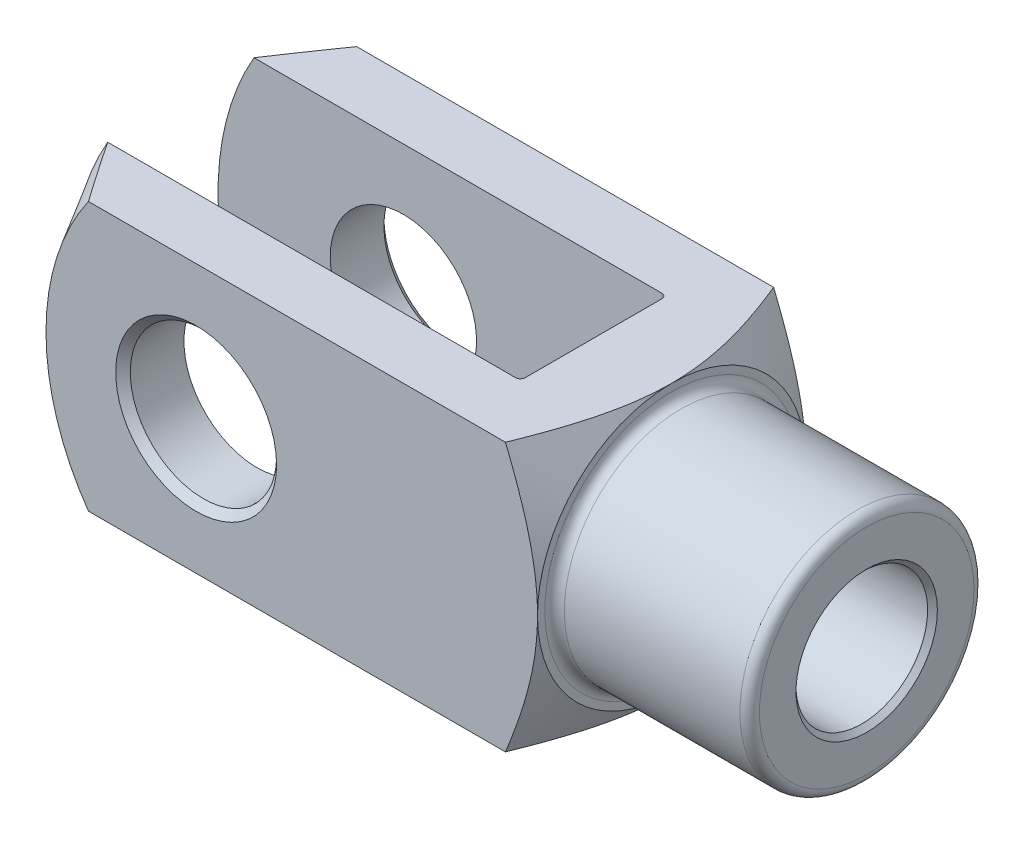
ISO-10303-21;
HEADER;
FILE_DESCRIPTION(('STEP AP214'),'2;1');
FILE_NAME('part.step','',(''),(''),'','','');
FILE_SCHEMA(('AUTOMOTIVE_DESIGN { 1 0 10303 214 1 1 1 1 }'));
ENDSEC;
DATA;
#1=APPLICATION_CONTEXT('core data for automotive mechanical design processes');
#2=APPLICATION_PROTOCOL_DEFINITION('international standard','automotive_design',2000,#1);
#3=PRODUCT_CONTEXT('',#1,'mechanical');
#4=PRODUCT('Part','Part','',(#3));
#5=PRODUCT_RELATED_PRODUCT_CATEGORY('part','',(#4));
#6=PRODUCT_DEFINITION_FORMATION('','',#4);
#7=PRODUCT_DEFINITION_CONTEXT('part definition',#1,'design');
#8=PRODUCT_DEFINITION('design','',#6,#7);
#9=PRODUCT_DEFINITION_SHAPE('','',#8);
#10=(LENGTH_UNIT() NAMED_UNIT(*) SI_UNIT(.MILLI.,.METRE.));
#11=(NAMED_UNIT(*) PLANE_ANGLE_UNIT() SI_UNIT($,.RADIAN.));
#12=(NAMED_UNIT(*) SI_UNIT($,.STERADIAN.) SOLID_ANGLE_UNIT());
#13=UNCERTAINTY_MEASURE_WITH_UNIT(LENGTH_MEASURE(1.E-05),#10,'distance_accuracy_value','');
#14=(GEOMETRIC_REPRESENTATION_CONTEXT(3) GLOBAL_UNCERTAINTY_ASSIGNED_CONTEXT((#13)) GLOBAL_UNIT_ASSIGNED_CONTEXT((#10,
#11,#12)) REPRESENTATION_CONTEXT('',''));
#15=CARTESIAN_POINT('',(0.,0.,0.));
#16=DIRECTION('',(0.,0.,1.));
#17=DIRECTION('',(1.,0.,0.));
#18=AXIS2_PLACEMENT_3D('',#15,#16,#17);
#19=CARTESIAN_POINT('',(-148.,-27.5,-15.));
#20=DIRECTION('',(0.,0.,-1.));
#21=DIRECTION('',(-1.,0.,0.));
#22=AXIS2_PLACEMENT_3D('',#19,#20,#21);
#23=PLANE('',#22);
#24=CARTESIAN_POINT('',(-110.,0.,-15.));
#25=DIRECTION('',(0.,0.,-1.));
#26=DIRECTION('',(-1.,0.,0.));
#27=AXIS2_PLACEMENT_3D('',#24,#25,#26);
#28=CIRCLE('',#27,15.);
#29=CARTESIAN_POINT('',(-125.,0.,-15.));
#30=VERTEX_POINT('',#29);
#31=EDGE_CURVE('E160',#30,#30,#28,.F.);
#32=ORIENTED_EDGE('',*,*,#31,.F.);
#33=EDGE_LOOP('',(#32));
#34=FACE_BOUND('',#33,.T.);
#35=DIRECTION('',(-1.,0.,0.));
#36=VECTOR('',#35,1.);
#37=CARTESIAN_POINT('',(-148.,27.5,-15.));
#38=LINE('',#37,#36);
#39=CARTESIAN_POINT('',(-57.,27.5,-15.));
#40=VERTEX_POINT('',#39);
#41=CARTESIAN_POINT('',(-140.631397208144,27.5,-15.));
#42=VERTEX_POINT('',#41);
#43=EDGE_CURVE('E331',#40,#42,#38,.T.);
#44=ORIENTED_EDGE('',*,*,#43,.T.);
#45=CARTESIAN_POINT('',(-93.,0.,-15.));
#46=DIRECTION('',(0.,0.,1.));
#47=DIRECTION('',(1.,0.,0.));
#48=AXIS2_PLACEMENT_3D('',#45,#46,#47);
#49=CIRCLE('',#48,55.);
#50=CARTESIAN_POINT('',(-140.631397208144,-27.5,-15.));
#51=VERTEX_POINT('',#50);
#52=EDGE_CURVE('E61',#42,#51,#49,.T.);
#53=ORIENTED_EDGE('',*,*,#52,.T.);
#54=DIRECTION('',(-1.,0.,0.));
#55=VECTOR('',#54,1.);
#56=CARTESIAN_POINT('',(-148.,-27.5,-15.));
#57=LINE('',#56,#55);
#58=CARTESIAN_POINT('',(-57.,-27.5,-15.));
#59=VERTEX_POINT('',#58);
#60=EDGE_CURVE('E322',#59,#51,#57,.T.);
#61=ORIENTED_EDGE('',*,*,#60,.F.);
#62=DIRECTION('',(0.,1.,0.));
#63=VECTOR('',#62,1.);
#64=CARTESIAN_POINT('',(-57.,27.5,-15.));
#65=LINE('',#64,#63);
#66=EDGE_CURVE('E183',#59,#40,#65,.T.);
#67=ORIENTED_EDGE('',*,*,#66,.T.);
#68=EDGE_LOOP('',(#44,#53,#61,#67));
#69=FACE_BOUND('',#68,.T.);
#70=ADVANCED_FACE('F37',(#34,#69),#23,.F.);
#71=CARTESIAN_POINT('',(-148.,-27.5,15.));
#72=DIRECTION('',(0.,0.,1.));
#73=DIRECTION('',(1.,0.,0.));
#74=AXIS2_PLACEMENT_3D('',#71,#72,#73);
#75=PLANE('',#74);
#76=CARTESIAN_POINT('',(-110.,0.,15.));
#77=DIRECTION('',(0.,0.,1.));
#78=DIRECTION('',(1.,0.,0.));
#79=AXIS2_PLACEMENT_3D('',#76,#77,#78);
#80=CIRCLE('',#79,15.);
#81=CARTESIAN_POINT('',(-95.,0.,15.));
#82=VERTEX_POINT('',#81);
#83=EDGE_CURVE('E164',#82,#82,#80,.F.);
#84=ORIENTED_EDGE('',*,*,#83,.F.);
#85=EDGE_LOOP('',(#84));
#86=FACE_BOUND('',#85,.T.);
#87=CARTESIAN_POINT('',(-93.,0.,15.));
#88=DIRECTION('',(0.,0.,1.));
#89=DIRECTION('',(1.,0.,0.));
#90=AXIS2_PLACEMENT_3D('',#87,#88,#89);
#91=CIRCLE('',#90,55.);
#92=CARTESIAN_POINT('',(-140.631397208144,27.5,15.));
#93=VERTEX_POINT('',#92);
#94=CARTESIAN_POINT('',(-140.631397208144,-27.5,15.));
#95=VERTEX_POINT('',#94);
#96=EDGE_CURVE('E128',#93,#95,#91,.T.);
#97=ORIENTED_EDGE('',*,*,#96,.F.);
#98=DIRECTION('',(1.,0.,0.));
#99=VECTOR('',#98,1.);
#100=CARTESIAN_POINT('',(-148.,27.5,15.));
#101=LINE('',#100,#99);
#102=CARTESIAN_POINT('',(-57.,27.5,15.));
#103=VERTEX_POINT('',#102);
#104=EDGE_CURVE('E335',#93,#103,#101,.T.);
#105=ORIENTED_EDGE('',*,*,#104,.T.);
#106=DIRECTION('',(0.,1.,0.));
#107=VECTOR('',#106,1.);
#108=CARTESIAN_POINT('',(-57.,-27.5,15.));
#109=LINE('',#108,#107);
#110=CARTESIAN_POINT('',(-57.,-27.5,15.));
#111=VERTEX_POINT('',#110);
#112=EDGE_CURVE('E179',#103,#111,#109,.F.);
#113=ORIENTED_EDGE('',*,*,#112,.T.);
#114=DIRECTION('',(1.,0.,0.));
#115=VECTOR('',#114,1.);
#116=CARTESIAN_POINT('',(-148.,-27.5,15.));
#117=LINE('',#116,#115);
#118=EDGE_CURVE('E324',#95,#111,#117,.T.);
#119=ORIENTED_EDGE('',*,*,#118,.F.);
#120=EDGE_LOOP('',(#97,#105,#113,#119));
#121=FACE_BOUND('',#120,.T.);
#122=ADVANCED_FACE('F401',(#86,#121),#75,.F.);
#123=CARTESIAN_POINT('',(-148.,-27.5,27.5));
#124=DIRECTION('',(0.,0.,1.));
#125=DIRECTION('',(1.,0.,0.));
#126=AXIS2_PLACEMENT_3D('',#123,#124,#125);
#127=PLANE('',#126);
#128=CARTESIAN_POINT('',(-110.,0.,27.5));
#129=DIRECTION('',(0.,0.,1.));
#130=DIRECTION('',(1.,0.,0.));
#131=AXIS2_PLACEMENT_3D('',#128,#129,#130);
#132=CIRCLE('',#131,16.5);
#133=CARTESIAN_POINT('',(-93.5,0.,27.5));
#134=VERTEX_POINT('',#133);
#135=EDGE_CURVE('E227',#134,#134,#132,.F.);
#136=ORIENTED_EDGE('',*,*,#135,.T.);
#137=EDGE_LOOP('',(#136));
#138=FACE_BOUND('',#137,.T.);
#139=DIRECTION('',(1.,0.,0.));
#140=VECTOR('',#139,1.);
#141=CARTESIAN_POINT('',(-148.,27.5,27.5));
#142=LINE('',#141,#140);
#143=CARTESIAN_POINT('',(-132.076549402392,27.5,27.5));
#144=VERTEX_POINT('',#143);
#145=CARTESIAN_POINT('',(-46.5765235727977,27.5,27.5));
#146=VERTEX_POINT('',#145);
#147=EDGE_CURVE('E142',#144,#146,#142,.T.);
#148=ORIENTED_EDGE('',*,*,#147,.F.);
#149=CARTESIAN_POINT('',(-93.,0.,27.5));
#150=DIRECTION('',(0.,0.,1.));
#151=DIRECTION('',(1.,0.,0.));
#152=AXIS2_PLACEMENT_3D('',#149,#150,#151);
#153=CIRCLE('',#152,47.7831216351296);
#154=CARTESIAN_POINT('',(-132.076549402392,-27.5,27.5));
#155=VERTEX_POINT('',#154);
#156=EDGE_CURVE('E53',#144,#155,#153,.T.);
#157=ORIENTED_EDGE('',*,*,#156,.T.);
#158=DIRECTION('',(1.,0.,0.));
#159=VECTOR('',#158,1.);
#160=CARTESIAN_POINT('',(-148.,-27.5,27.5));
#161=LINE('',#160,#159);
#162=CARTESIAN_POINT('',(-46.5765235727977,-27.5,27.5));
#163=VERTEX_POINT('',#162);
#164=EDGE_CURVE('E139',#155,#163,#161,.T.);
#165=ORIENTED_EDGE('',*,*,#164,.T.);
#166=CARTESIAN_POINT('',(-60.2286520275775,-56.1661197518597,27.5));
#167=CARTESIAN_POINT('',(-59.8772635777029,-55.488454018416,27.5));
#168=CARTESIAN_POINT('',(-59.5268382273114,-54.8102891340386,27.5));
#169=CARTESIAN_POINT('',(-58.8281196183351,-53.4528592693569,27.5));
#170=CARTESIAN_POINT('',(-58.4798263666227,-52.7735942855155,27.5));
#171=CARTESIAN_POINT('',(-57.4384219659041,-50.7339344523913,27.5));
#172=CARTESIAN_POINT('',(-56.7488216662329,-49.3717430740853,27.5));
#173=CARTESIAN_POINT('',(-55.379898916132,-46.6392326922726,27.5));
#174=CARTESIAN_POINT('',(-54.700596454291,-45.2689036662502,27.5));
#175=CARTESIAN_POINT('',(-53.3562706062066,-42.5212693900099,27.5));
#176=CARTESIAN_POINT('',(-52.6912469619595,-41.1439642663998,27.5));
#177=CARTESIAN_POINT('',(-51.6870177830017,-39.0290973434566,27.5));
#178=CARTESIAN_POINT('',(-51.341352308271,-38.2946014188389,27.5));
#179=CARTESIAN_POINT('',(-50.6557933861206,-36.8229224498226,27.5));
#180=CARTESIAN_POINT('',(-50.3158999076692,-36.0857394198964,27.5));
#181=CARTESIAN_POINT('',(-49.6426674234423,-34.6083269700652,27.5));
#182=CARTESIAN_POINT('',(-49.3093288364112,-33.8680973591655,27.5));
#183=CARTESIAN_POINT('',(-48.6501852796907,-32.3842946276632,27.5));
#184=CARTESIAN_POINT('',(-48.3243802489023,-31.6407215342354,27.5));
#185=CARTESIAN_POINT('',(-47.6815641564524,-30.1501576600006,27.5));
#186=CARTESIAN_POINT('',(-47.3645493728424,-29.4031684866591,27.5));
#187=CARTESIAN_POINT('',(-46.7405004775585,-27.9050353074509,27.5));
#188=CARTESIAN_POINT('',(-46.4334662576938,-27.1538913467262,27.5));
#189=CARTESIAN_POINT('',(-45.8309720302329,-25.6470429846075,27.5));
#190=CARTESIAN_POINT('',(-45.5355109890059,-24.8913389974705,27.5));
#191=CARTESIAN_POINT('',(-44.9579969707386,-23.374828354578,27.5));
#192=CARTESIAN_POINT('',(-44.6759438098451,-22.6140217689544,27.5));
#193=CARTESIAN_POINT('',(-44.0679304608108,-20.9211908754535,27.5));
#194=CARTESIAN_POINT('',(-43.7457124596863,-19.9878144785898,27.5));
#195=CARTESIAN_POINT('',(-43.1290045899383,-18.1119849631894,27.5));
#196=CARTESIAN_POINT('',(-42.8345123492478,-17.1695326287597,27.5));
#197=CARTESIAN_POINT('',(-42.2787221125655,-15.2748429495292,27.5));
#198=CARTESIAN_POINT('',(-42.0174234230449,-14.3226058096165,27.5));
#199=CARTESIAN_POINT('',(-41.5342616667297,-12.4080936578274,27.5));
#200=CARTESIAN_POINT('',(-41.3123981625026,-11.4458187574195,27.5));
#201=CARTESIAN_POINT('',(-40.9194598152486,-9.53441211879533,27.5));
#202=CARTESIAN_POINT('',(-40.7473150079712,-8.58550210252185,27.5));
#203=CARTESIAN_POINT('',(-40.4530867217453,-6.67982263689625,27.5));
#204=CARTESIAN_POINT('',(-40.331001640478,-5.72305344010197,27.5));
#205=CARTESIAN_POINT('',(-40.1891957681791,-4.28420703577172,27.5));
#206=CARTESIAN_POINT('',(-40.1488192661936,-3.80410222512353,27.5));
#207=CARTESIAN_POINT('',(-40.0822400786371,-2.84291838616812,27.5));
#208=CARTESIAN_POINT('',(-40.0560367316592,-2.36183940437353,27.5));
#209=CARTESIAN_POINT('',(-40.0181172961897,-1.39910944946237,27.5));
#210=CARTESIAN_POINT('',(-40.0064011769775,-0.917458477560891,27.5));
#211=CARTESIAN_POINT('',(-39.9975849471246,0.0459618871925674,27.5));
#212=CARTESIAN_POINT('',(-40.0004847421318,0.527731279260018,27.5));
#213=CARTESIAN_POINT('',(-40.0296149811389,1.90235979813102,27.5));
#214=CARTESIAN_POINT('',(-40.0736560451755,2.79490249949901,27.5));
#215=CARTESIAN_POINT('',(-40.2102476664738,4.57617108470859,27.5));
#216=CARTESIAN_POINT('',(-40.3027981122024,5.46489697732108,27.5));
#217=CARTESIAN_POINT('',(-40.5329956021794,7.23690381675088,27.5));
#218=CARTESIAN_POINT('',(-40.6706659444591,8.12018170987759,27.5));
#219=CARTESIAN_POINT('',(-40.9865696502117,9.87940375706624,27.5));
#220=CARTESIAN_POINT('',(-41.1648041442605,10.7553477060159,27.5));
#221=CARTESIAN_POINT('',(-41.5625503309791,12.5244022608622,27.5));
#222=CARTESIAN_POINT('',(-41.7831074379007,13.4172759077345,27.5));
#223=CARTESIAN_POINT('',(-42.2566003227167,15.1943548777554,27.5));
#224=CARTESIAN_POINT('',(-42.5095364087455,16.0785601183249,27.5));
#225=CARTESIAN_POINT('',(-42.9095547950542,17.3985328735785,27.5));
#226=CARTESIAN_POINT('',(-43.0463285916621,17.8374638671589,27.5));
#227=CARTESIAN_POINT('',(-43.3262073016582,18.7133062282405,27.5));
#228=CARTESIAN_POINT('',(-43.469312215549,19.1502175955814,27.5));
#229=CARTESIAN_POINT('',(-43.7613249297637,20.0220652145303,27.5));
#230=CARTESIAN_POINT('',(-43.9102323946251,20.4570015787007,27.5));
#231=CARTESIAN_POINT('',(-44.2133836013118,21.3250056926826,27.5));
#232=CARTESIAN_POINT('',(-44.3676273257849,21.7580734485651,27.5));
#233=CARTESIAN_POINT('',(-44.8632318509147,23.1250498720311,27.5));
#234=CARTESIAN_POINT('',(-45.2135920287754,24.0557046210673,27.5));
#235=CARTESIAN_POINT('',(-45.9333349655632,25.9096511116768,27.5));
#236=CARTESIAN_POINT('',(-46.3027188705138,26.8329424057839,27.5));
#237=CARTESIAN_POINT('',(-47.0574378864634,28.6732112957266,27.5));
#238=CARTESIAN_POINT('',(-47.4427765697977,29.59018742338,27.5));
#239=CARTESIAN_POINT('',(-48.2267507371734,31.4184035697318,27.5));
#240=CARTESIAN_POINT('',(-48.6253859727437,32.3296436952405,27.5));
#241=CARTESIAN_POINT('',(-49.4342203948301,34.1479110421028,27.5));
#242=CARTESIAN_POINT('',(-49.8444292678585,35.054933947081,27.5));
#243=CARTESIAN_POINT('',(-50.674373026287,36.8646088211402,27.5));
#244=CARTESIAN_POINT('',(-51.0941079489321,37.7672607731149,27.5));
#245=CARTESIAN_POINT('',(-51.9416536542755,39.5686363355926,27.5));
#246=CARTESIAN_POINT('',(-52.3694635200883,40.4673603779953,27.5));
#247=CARTESIAN_POINT('',(-53.232051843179,42.2614529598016,27.5));
#248=CARTESIAN_POINT('',(-53.6668302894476,43.1568215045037,27.5));
#249=CARTESIAN_POINT('',(-54.5437336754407,44.9473331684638,27.5));
#250=CARTESIAN_POINT('',(-54.9858769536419,45.8424672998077,27.5));
#251=CARTESIAN_POINT('',(-55.8754180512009,47.6301222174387,27.5));
#252=CARTESIAN_POINT('',(-56.3228158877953,48.5226429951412,27.5));
#253=CARTESIAN_POINT('',(-57.6718703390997,51.1967817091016,27.5));
#254=CARTESIAN_POINT('',(-58.5803735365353,52.9749468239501,27.5));
#255=CARTESIAN_POINT('',(-60.4109841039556,56.5231320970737,27.5));
#256=CARTESIAN_POINT('',(-61.3330845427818,58.2931558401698,27.5));
#257=CARTESIAN_POINT('',(-63.1883406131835,61.8273779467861,27.5));
#258=CARTESIAN_POINT('',(-64.1214961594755,63.5915763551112,27.5));
#259=CARTESIAN_POINT('',(-65.857416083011,66.8536122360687,27.5));
#260=CARTESIAN_POINT('',(-66.6589641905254,68.3520976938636,27.5));
#261=CARTESIAN_POINT('',(-68.2674305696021,71.34618514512,27.5));
#262=CARTESIAN_POINT('',(-69.0743488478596,72.8417871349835,27.5));
#263=CARTESIAN_POINT('',(-70.6928273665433,75.830747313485,27.5));
#264=CARTESIAN_POINT('',(-71.5043882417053,77.3241051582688,27.5));
#265=CARTESIAN_POINT('',(-73.1313659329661,80.3087190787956,27.5));
#266=CARTESIAN_POINT('',(-73.9467827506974,81.7999751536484,27.5));
#267=CARTESIAN_POINT('',(-75.5762426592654,84.7721370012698,27.5));
#268=CARTESIAN_POINT('',(-76.3902668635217,86.2530531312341,27.5));
#269=CARTESIAN_POINT('',(-78.0211422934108,89.2133282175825,27.5));
#270=CARTESIAN_POINT('',(-78.8379935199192,90.6926871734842,27.5));
#271=CARTESIAN_POINT('',(-80.4740235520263,93.6498117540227,27.5));
#272=CARTESIAN_POINT('',(-81.2932019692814,95.1275775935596,27.5));
#273=CARTESIAN_POINT('',(-82.9337176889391,98.0819083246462,27.5));
#274=CARTESIAN_POINT('',(-83.7550549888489,99.5584732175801,27.5));
#275=CARTESIAN_POINT('',(-84.5773240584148,101.034518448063,27.5));
#276=B_SPLINE_CURVE_WITH_KNOTS('',3,(#166,#167,#168,#169,#170,#171,#172,#173,#174,#175,#176,
#177,#178,#179,#180,#181,#182,#183,#184,#185,#186,#187,#188,#189,#190,#191,#192,#193,#194,#195,
#196,#197,#198,#199,#200,#201,#202,#203,#204,#205,#206,#207,#208,#209,#210,#211,#212,#213,#214,
#215,#216,#217,#218,#219,#220,#221,#222,#223,#224,#225,#226,#227,#228,#229,#230,#231,#232,#233,
#234,#235,#236,#237,#238,#239,#240,#241,#242,#243,#244,#245,#246,#247,#248,#249,#250,#251,#252,
#253,#254,#255,#256,#257,#258,#259,#260,#261,#262,#263,#264,#265,#266,#267,#268,#269,#270,#271,
#272,#273,#274,#275),.UNSPECIFIED.,.F.,.F.,(4,2,2,2,2,2,2,2,2,2,2,2,2,2,2,2,2,2,2,2,2,2,2,2,2,2,
2,2,2,2,2,2,2,2,2,2,2,2,2,2,2,2,2,2,2,2,2,2,2,2,2,2,2,2,4),(0.,2.29005127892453,
4.58010993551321,9.16045830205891,13.7487827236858,18.3370241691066,20.7723109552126,
23.2075846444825,25.643013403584,28.0784224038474,30.5127839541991,32.9471191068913,
35.3812363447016,37.8153201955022,40.7772407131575,43.7389075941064,46.7005125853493,
49.6620847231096,52.5541365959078,55.4460958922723,56.8913195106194,58.3364756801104,
59.7816287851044,61.226772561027,63.9061566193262,66.5855345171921,69.2662981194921,
71.9471364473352,74.7055692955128,77.4640283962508,78.8432321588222,80.2224360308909,
81.6015602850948,82.9806800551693,85.9636558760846,88.9468116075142,91.930638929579,
94.9144105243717,97.9007581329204,100.887117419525,103.873139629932,106.859157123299,
109.85426683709,112.849386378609,118.839723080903,124.827105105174,130.814440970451,
135.912609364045,141.010784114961,146.109673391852,151.208564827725,156.278248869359,
161.347934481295,166.416818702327,171.485697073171),.UNSPECIFIED.);
#277=CARTESIAN_POINT('',(-40.,0.,27.5));
#278=VERTEX_POINT('',#277);
#279=EDGE_CURVE('E294',#278,#163,#276,.F.);
#280=ORIENTED_EDGE('',*,*,#279,.F.);
#281=EDGE_CURVE('E292',#146,#278,#276,.F.);
#282=ORIENTED_EDGE('',*,*,#281,.F.);
#283=EDGE_LOOP('',(#148,#157,#165,#280,#282));
#284=FACE_BOUND('',#283,.T.);
#285=ADVANCED_FACE('F137',(#138,#284),#127,.T.);
#286=CARTESIAN_POINT('',(-148.,-27.5,27.5));
#287=DIRECTION('',(0.,-1.,0.));
#288=DIRECTION('',(0.,0.,-1.));
#289=AXIS2_PLACEMENT_3D('',#286,#287,#288);
#290=PLANE('',#289);
#291=ORIENTED_EDGE('',*,*,#60,.T.);
#292=CARTESIAN_POINT('',(-175.427038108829,-27.5,40.2410255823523));
#293=CARTESIAN_POINT('',(-174.665681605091,-27.5,38.9901043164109));
#294=CARTESIAN_POINT('',(-173.903558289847,-27.5,37.7396497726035));
#295=CARTESIAN_POINT('',(-172.377637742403,-27.5,35.2397620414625));
#296=CARTESIAN_POINT('',(-171.613840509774,-27.5,33.99032885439));
#297=CARTESIAN_POINT('',(-169.31971610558,-27.5,30.2436746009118));
#298=CARTESIAN_POINT('',(-167.786668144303,-27.5,27.7481184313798));
#299=CARTESIAN_POINT('',(-164.711763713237,-27.5,22.762031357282));
#300=CARTESIAN_POINT('',(-163.16990623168,-27.5,20.2715010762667));
#301=CARTESIAN_POINT('',(-160.849317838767,-27.5,16.5405654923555));
#302=CARTESIAN_POINT('',(-160.074489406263,-27.5,15.2977324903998));
#303=CARTESIAN_POINT('',(-158.521952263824,-27.5,12.8138622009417));
#304=CARTESIAN_POINT('',(-157.744243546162,-27.5,11.5728249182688));
#305=CARTESIAN_POINT('',(-155.409736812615,-27.5,7.858082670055));
#306=CARTESIAN_POINT('',(-153.848204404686,-27.5,5.38734954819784));
#307=CARTESIAN_POINT('',(-150.70953441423,-27.5,0.455814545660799));
#308=CARTESIAN_POINT('',(-149.13239689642,-27.5,-2.00498737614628));
#309=CARTESIAN_POINT('',(-146.751879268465,-27.5,-5.68668533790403));
#310=CARTESIAN_POINT('',(-145.955887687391,-27.5,-6.91235989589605));
#311=CARTESIAN_POINT('',(-144.358313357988,-27.5,-9.36005853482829));
#312=CARTESIAN_POINT('',(-143.556730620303,-27.5,-10.5820826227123));
#313=CARTESIAN_POINT('',(-141.947217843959,-27.5,-13.0219297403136));
#314=CARTESIAN_POINT('',(-141.139287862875,-27.5,-14.2397528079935));
#315=CARTESIAN_POINT('',(-139.516157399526,-27.5,-16.6705414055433));
#316=CARTESIAN_POINT('',(-138.700956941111,-27.5,-17.8835069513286));
#317=CARTESIAN_POINT('',(-137.060885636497,-27.5,-20.3056753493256));
#318=CARTESIAN_POINT('',(-136.236001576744,-27.5,-21.5148692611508));
#319=CARTESIAN_POINT('',(-134.576479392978,-27.5,-23.9265375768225));
#320=CARTESIAN_POINT('',(-133.741841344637,-27.5,-25.1290120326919));
#321=CARTESIAN_POINT('',(-132.061335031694,-27.5,-27.5256714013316));
#322=CARTESIAN_POINT('',(-131.215469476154,-27.5,-28.7198582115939));
#323=CARTESIAN_POINT('',(-129.510212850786,-27.5,-31.0985969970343));
#324=CARTESIAN_POINT('',(-128.650821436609,-27.5,-32.283148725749));
#325=CARTESIAN_POINT('',(-126.914875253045,-27.5,-34.6417940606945));
#326=CARTESIAN_POINT('',(-126.038301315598,-27.5,-35.8158735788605));
#327=CARTESIAN_POINT('',(-124.265663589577,-27.5,-38.14914856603));
#328=CARTESIAN_POINT('',(-123.369601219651,-27.5,-39.3083451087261));
#329=CARTESIAN_POINT('',(-122.007185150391,-27.5,-41.0333702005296));
#330=CARTESIAN_POINT('',(-121.549814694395,-27.5,-41.6062995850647));
#331=CARTESIAN_POINT('',(-120.628369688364,-27.5,-42.7467325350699));
#332=CARTESIAN_POINT('',(-120.164295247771,-27.5,-43.3142361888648));
#333=CARTESIAN_POINT('',(-119.228546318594,-27.5,-44.4431840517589));
#334=CARTESIAN_POINT('',(-118.756870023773,-27.5,-45.0046267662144));
#335=CARTESIAN_POINT('',(-117.805046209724,-27.5,-46.1203356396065));
#336=CARTESIAN_POINT('',(-117.324898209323,-27.5,-46.6746013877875));
#337=CARTESIAN_POINT('',(-116.840050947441,-27.5,-47.2247575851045));
#338=B_SPLINE_CURVE_WITH_KNOTS('',3,(#292,#293,#294,#295,#296,#297,#298,#299,#300,#301,#302,
#303,#304,#305,#306,#307,#308,#309,#310,#311,#312,#313,#314,#315,#316,#317,#318,#319,#320,#321,
#322,#323,#324,#325,#326,#327,#328,#329,#330,#331,#332,#333,#334,#335,#336,#337),.UNSPECIFIED.,
.F.,.F.,(4,2,2,2,2,2,2,2,2,2,2,2,2,2,2,2,2,2,2,2,2,2,4),(0.,4.39319996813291,8.78640105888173,
17.572872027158,26.3603732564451,30.7541081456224,35.1478548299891,43.9162839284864,
52.6846766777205,57.0690602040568,61.4534353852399,65.8377708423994,70.2220919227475,
74.6133213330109,79.0045166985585,83.3946711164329,87.7849374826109,92.1804168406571,
96.5755772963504,98.7748364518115,100.974059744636,103.173813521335,105.373692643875),.UNSPECIFIED.);
#339=CARTESIAN_POINT('',(-132.076549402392,-27.5,-27.5));
#340=VERTEX_POINT('',#339);
#341=EDGE_CURVE('E133',#51,#340,#338,.T.);
#342=ORIENTED_EDGE('',*,*,#341,.T.);
#343=DIRECTION('',(1.,0.,0.));
#344=VECTOR('',#343,1.);
#345=CARTESIAN_POINT('',(-148.,-27.5,-27.5));
#346=LINE('',#345,#344);
#347=CARTESIAN_POINT('',(-46.5765235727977,-27.5,-27.5));
#348=VERTEX_POINT('',#347);
#349=EDGE_CURVE('E152',#340,#348,#346,.T.);
#350=ORIENTED_EDGE('',*,*,#349,.T.);
#351=CARTESIAN_POINT('',(-60.2286520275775,-27.5,-56.1661197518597));
#352=CARTESIAN_POINT('',(-59.8772635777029,-27.5,-55.488454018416));
#353=CARTESIAN_POINT('',(-59.5268382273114,-27.5,-54.8102891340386));
#354=CARTESIAN_POINT('',(-58.8281196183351,-27.5,-53.4528592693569));
#355=CARTESIAN_POINT('',(-58.4798263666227,-27.5,-52.7735942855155));
#356=CARTESIAN_POINT('',(-57.4384219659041,-27.5,-50.7339344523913));
#357=CARTESIAN_POINT('',(-56.7488216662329,-27.5,-49.3717430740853));
#358=CARTESIAN_POINT('',(-55.379898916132,-27.5,-46.6392326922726));
#359=CARTESIAN_POINT('',(-54.700596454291,-27.5,-45.2689036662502));
#360=CARTESIAN_POINT('',(-53.3562706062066,-27.5,-42.5212693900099));
#361=CARTESIAN_POINT('',(-52.6912469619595,-27.5,-41.1439642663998));
#362=CARTESIAN_POINT('',(-51.6870177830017,-27.5,-39.0290973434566));
#363=CARTESIAN_POINT('',(-51.341352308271,-27.5,-38.2946014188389));
#364=CARTESIAN_POINT('',(-50.6557933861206,-27.5,-36.8229224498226));
#365=CARTESIAN_POINT('',(-50.3158999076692,-27.5,-36.0857394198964));
#366=CARTESIAN_POINT('',(-49.6426674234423,-27.5,-34.6083269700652));
#367=CARTESIAN_POINT('',(-49.3093288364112,-27.5,-33.8680973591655));
#368=CARTESIAN_POINT('',(-48.6501852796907,-27.5,-32.3842946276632));
#369=CARTESIAN_POINT('',(-48.3243802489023,-27.5,-31.6407215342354));
#370=CARTESIAN_POINT('',(-47.6815641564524,-27.5,-30.1501576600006));
#371=CARTESIAN_POINT('',(-47.3645493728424,-27.5,-29.4031684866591));
#372=CARTESIAN_POINT('',(-46.7405004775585,-27.5,-27.9050353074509));
#373=CARTESIAN_POINT('',(-46.4334662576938,-27.5,-27.1538913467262));
#374=CARTESIAN_POINT('',(-45.8309720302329,-27.5,-25.6470429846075));
#375=CARTESIAN_POINT('',(-45.5355109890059,-27.5,-24.8913389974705));
#376=CARTESIAN_POINT('',(-44.9579969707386,-27.5,-23.374828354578));
#377=CARTESIAN_POINT('',(-44.6759438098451,-27.5,-22.6140217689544));
#378=CARTESIAN_POINT('',(-44.0679304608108,-27.5,-20.9211908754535));
#379=CARTESIAN_POINT('',(-43.7457124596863,-27.5,-19.9878144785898));
#380=CARTESIAN_POINT('',(-43.1290045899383,-27.5,-18.1119849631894));
#381=CARTESIAN_POINT('',(-42.8345123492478,-27.5,-17.1695326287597));
#382=CARTESIAN_POINT('',(-42.2787221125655,-27.5,-15.2748429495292));
#383=CARTESIAN_POINT('',(-42.0174234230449,-27.5,-14.3226058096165));
#384=CARTESIAN_POINT('',(-41.5342616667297,-27.5,-12.4080936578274));
#385=CARTESIAN_POINT('',(-41.3123981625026,-27.5,-11.4458187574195));
#386=CARTESIAN_POINT('',(-40.9194598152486,-27.5,-9.53441211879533));
#387=CARTESIAN_POINT('',(-40.7473150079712,-27.5,-8.58550210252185));
#388=CARTESIAN_POINT('',(-40.4530867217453,-27.5,-6.67982263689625));
#389=CARTESIAN_POINT('',(-40.331001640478,-27.5,-5.72305344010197));
#390=CARTESIAN_POINT('',(-40.1891957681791,-27.5,-4.28420703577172));
#391=CARTESIAN_POINT('',(-40.1488192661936,-27.5,-3.80410222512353));
#392=CARTESIAN_POINT('',(-40.0822400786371,-27.5,-2.84291838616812));
#393=CARTESIAN_POINT('',(-40.0560367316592,-27.5,-2.36183940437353));
#394=CARTESIAN_POINT('',(-40.0181172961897,-27.5,-1.39910944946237));
#395=CARTESIAN_POINT('',(-40.0064011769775,-27.5,-0.917458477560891));
#396=CARTESIAN_POINT('',(-39.9975849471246,-27.5,0.0459618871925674));
#397=CARTESIAN_POINT('',(-40.0004847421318,-27.5,0.527731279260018));
#398=CARTESIAN_POINT('',(-40.0296149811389,-27.5,1.90235979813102));
#399=CARTESIAN_POINT('',(-40.0736560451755,-27.5,2.79490249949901));
#400=CARTESIAN_POINT('',(-40.2102476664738,-27.5,4.57617108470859));
#401=CARTESIAN_POINT('',(-40.3027981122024,-27.5,5.46489697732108));
#402=CARTESIAN_POINT('',(-40.5329956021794,-27.5,7.23690381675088));
#403=CARTESIAN_POINT('',(-40.6706659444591,-27.5,8.12018170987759));
#404=CARTESIAN_POINT('',(-40.9865696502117,-27.5,9.87940375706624));
#405=CARTESIAN_POINT('',(-41.1648041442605,-27.5,10.7553477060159));
#406=CARTESIAN_POINT('',(-41.5625503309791,-27.5,12.5244022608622));
#407=CARTESIAN_POINT('',(-41.7831074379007,-27.5,13.4172759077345));
#408=CARTESIAN_POINT('',(-42.2566003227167,-27.5,15.1943548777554));
#409=CARTESIAN_POINT('',(-42.5095364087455,-27.5,16.0785601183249));
#410=CARTESIAN_POINT('',(-42.9095547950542,-27.5,17.3985328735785));
#411=CARTESIAN_POINT('',(-43.0463285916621,-27.5,17.8374638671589));
#412=CARTESIAN_POINT('',(-43.3262073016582,-27.5,18.7133062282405));
#413=CARTESIAN_POINT('',(-43.469312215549,-27.5,19.1502175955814));
#414=CARTESIAN_POINT('',(-43.7613249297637,-27.5,20.0220652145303));
#415=CARTESIAN_POINT('',(-43.9102323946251,-27.5,20.4570015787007));
#416=CARTESIAN_POINT('',(-44.2133836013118,-27.5,21.3250056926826));
#417=CARTESIAN_POINT('',(-44.3676273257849,-27.5,21.7580734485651));
#418=CARTESIAN_POINT('',(-44.8632318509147,-27.5,23.1250498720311));
#419=CARTESIAN_POINT('',(-45.2135920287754,-27.5,24.0557046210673));
#420=CARTESIAN_POINT('',(-45.9333349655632,-27.5,25.9096511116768));
#421=CARTESIAN_POINT('',(-46.3027188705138,-27.5,26.8329424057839));
#422=CARTESIAN_POINT('',(-47.0574378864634,-27.5,28.6732112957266));
#423=CARTESIAN_POINT('',(-47.4427765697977,-27.5,29.59018742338));
#424=CARTESIAN_POINT('',(-48.2267507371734,-27.5,31.4184035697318));
#425=CARTESIAN_POINT('',(-48.6253859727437,-27.5,32.3296436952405));
#426=CARTESIAN_POINT('',(-49.4342203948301,-27.5,34.1479110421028));
#427=CARTESIAN_POINT('',(-49.8444292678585,-27.5,35.054933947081));
#428=CARTESIAN_POINT('',(-50.674373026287,-27.5,36.8646088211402));
#429=CARTESIAN_POINT('',(-51.0941079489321,-27.5,37.7672607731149));
#430=CARTESIAN_POINT('',(-51.9416536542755,-27.5,39.5686363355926));
#431=CARTESIAN_POINT('',(-52.3694635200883,-27.5,40.4673603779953));
#432=CARTESIAN_POINT('',(-53.232051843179,-27.5,42.2614529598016));
#433=CARTESIAN_POINT('',(-53.6668302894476,-27.5,43.1568215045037));
#434=CARTESIAN_POINT('',(-54.5437336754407,-27.5,44.9473331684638));
#435=CARTESIAN_POINT('',(-54.9858769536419,-27.5,45.8424672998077));
#436=CARTESIAN_POINT('',(-55.8754180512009,-27.5,47.6301222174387));
#437=CARTESIAN_POINT('',(-56.3228158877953,-27.5,48.5226429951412));
#438=CARTESIAN_POINT('',(-57.6718703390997,-27.5,51.1967817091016));
#439=CARTESIAN_POINT('',(-58.5803735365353,-27.5,52.9749468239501));
#440=CARTESIAN_POINT('',(-60.4109841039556,-27.5,56.5231320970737));
#441=CARTESIAN_POINT('',(-61.3330845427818,-27.5,58.2931558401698));
#442=CARTESIAN_POINT('',(-63.1883406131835,-27.5,61.8273779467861));
#443=CARTESIAN_POINT('',(-64.1214961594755,-27.5,63.5915763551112));
#444=CARTESIAN_POINT('',(-65.857416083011,-27.5,66.8536122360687));
#445=CARTESIAN_POINT('',(-66.6589641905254,-27.5,68.3520976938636));
#446=CARTESIAN_POINT('',(-68.2674305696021,-27.5,71.34618514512));
#447=CARTESIAN_POINT('',(-69.0743488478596,-27.5,72.8417871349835));
#448=CARTESIAN_POINT('',(-70.6928273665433,-27.5,75.830747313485));
#449=CARTESIAN_POINT('',(-71.5043882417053,-27.5,77.3241051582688));
#450=CARTESIAN_POINT('',(-73.1313659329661,-27.5,80.3087190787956));
#451=CARTESIAN_POINT('',(-73.9467827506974,-27.5,81.7999751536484));
#452=CARTESIAN_POINT('',(-75.5762426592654,-27.5,84.7721370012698));
#453=CARTESIAN_POINT('',(-76.3902668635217,-27.5,86.2530531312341));
#454=CARTESIAN_POINT('',(-78.0211422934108,-27.5,89.2133282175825));
#455=CARTESIAN_POINT('',(-78.8379935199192,-27.5,90.6926871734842));
#456=CARTESIAN_POINT('',(-80.4740235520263,-27.5,93.6498117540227));
#457=CARTESIAN_POINT('',(-81.2932019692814,-27.5,95.1275775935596));
#458=CARTESIAN_POINT('',(-82.9337176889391,-27.5,98.0819083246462));
#459=CARTESIAN_POINT('',(-83.7550549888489,-27.5,99.5584732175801));
#460=CARTESIAN_POINT('',(-84.5773240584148,-27.5,101.034518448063));
#461=B_SPLINE_CURVE_WITH_KNOTS('',3,(#351,#352,#353,#354,#355,#356,#357,#358,#359,#360,#361,
#362,#363,#364,#365,#366,#367,#368,#369,#370,#371,#372,#373,#374,#375,#376,#377,#378,#379,#380,
#381,#382,#383,#384,#385,#386,#387,#388,#389,#390,#391,#392,#393,#394,#395,#396,#397,#398,#399,
#400,#401,#402,#403,#404,#405,#406,#407,#408,#409,#410,#411,#412,#413,#414,#415,#416,#417,#418,
#419,#420,#421,#422,#423,#424,#425,#426,#427,#428,#429,#430,#431,#432,#433,#434,#435,#436,#437,
#438,#439,#440,#441,#442,#443,#444,#445,#446,#447,#448,#449,#450,#451,#452,#453,#454,#455,#456,
#457,#458,#459,#460),.UNSPECIFIED.,.F.,.F.,(4,2,2,2,2,2,2,2,2,2,2,2,2,2,2,2,2,2,2,2,2,2,2,2,2,2,
2,2,2,2,2,2,2,2,2,2,2,2,2,2,2,2,2,2,2,2,2,2,2,2,2,2,2,2,4),(0.,2.29005127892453,
4.58010993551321,9.16045830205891,13.7487827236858,18.3370241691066,20.7723109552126,
23.2075846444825,25.643013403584,28.0784224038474,30.5127839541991,32.9471191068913,
35.3812363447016,37.8153201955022,40.7772407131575,43.7389075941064,46.7005125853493,
49.6620847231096,52.5541365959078,55.4460958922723,56.8913195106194,58.3364756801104,
59.7816287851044,61.226772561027,63.9061566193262,66.5855345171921,69.2662981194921,
71.9471364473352,74.7055692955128,77.4640283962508,78.8432321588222,80.2224360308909,
81.6015602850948,82.9806800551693,85.9636558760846,88.9468116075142,91.930638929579,
94.9144105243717,97.9007581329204,100.887117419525,103.873139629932,106.859157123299,
109.85426683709,112.849386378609,118.839723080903,124.827105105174,130.814440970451,
135.912609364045,141.010784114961,146.109673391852,151.208564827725,156.278248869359,
161.347934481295,166.416818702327,171.485697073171),.UNSPECIFIED.);
#462=CARTESIAN_POINT('',(-40.,-27.5,0.));
#463=VERTEX_POINT('',#462);
#464=EDGE_CURVE('E293',#463,#348,#461,.F.);
#465=ORIENTED_EDGE('',*,*,#464,.F.);
#466=EDGE_CURVE('E150',#163,#463,#461,.F.);
#467=ORIENTED_EDGE('',*,*,#466,.F.);
#468=ORIENTED_EDGE('',*,*,#164,.F.);
#469=CARTESIAN_POINT('',(-116.840050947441,-27.5,47.2247575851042));
#470=CARTESIAN_POINT('',(-117.324898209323,-27.5,46.6746013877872));
#471=CARTESIAN_POINT('',(-117.805046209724,-27.5,46.1203356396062));
#472=CARTESIAN_POINT('',(-118.756870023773,-27.5,45.0046267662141));
#473=CARTESIAN_POINT('',(-119.228546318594,-27.5,44.4431840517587));
#474=CARTESIAN_POINT('',(-120.164295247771,-27.5,43.3142361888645));
#475=CARTESIAN_POINT('',(-120.628369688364,-27.5,42.7467325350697));
#476=CARTESIAN_POINT('',(-121.549814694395,-27.5,41.6062995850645));
#477=CARTESIAN_POINT('',(-122.007185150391,-27.5,41.0333702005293));
#478=CARTESIAN_POINT('',(-123.369601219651,-27.5,39.3083451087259));
#479=CARTESIAN_POINT('',(-124.265663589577,-27.5,38.1491485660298));
#480=CARTESIAN_POINT('',(-126.038301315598,-27.5,35.8158735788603));
#481=CARTESIAN_POINT('',(-126.914875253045,-27.5,34.6417940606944));
#482=CARTESIAN_POINT('',(-128.650821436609,-27.5,32.2831487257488));
#483=CARTESIAN_POINT('',(-129.510212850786,-27.5,31.0985969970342));
#484=CARTESIAN_POINT('',(-131.215469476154,-27.5,28.7198582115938));
#485=CARTESIAN_POINT('',(-132.061335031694,-27.5,27.5256714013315));
#486=CARTESIAN_POINT('',(-133.741841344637,-27.5,25.1290120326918));
#487=CARTESIAN_POINT('',(-134.576479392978,-27.5,23.9265375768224));
#488=CARTESIAN_POINT('',(-136.236001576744,-27.5,21.5148692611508));
#489=CARTESIAN_POINT('',(-137.060885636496,-27.5,20.3056753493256));
#490=CARTESIAN_POINT('',(-138.700956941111,-27.5,17.8835069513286));
#491=CARTESIAN_POINT('',(-139.516157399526,-27.5,16.6705414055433));
#492=CARTESIAN_POINT('',(-141.139287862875,-27.5,14.2397528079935));
#493=CARTESIAN_POINT('',(-141.947217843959,-27.5,13.0219297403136));
#494=CARTESIAN_POINT('',(-143.556730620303,-27.5,10.5820826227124));
#495=CARTESIAN_POINT('',(-144.358313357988,-27.5,9.36005853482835));
#496=CARTESIAN_POINT('',(-145.955887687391,-27.5,6.91235989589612));
#497=CARTESIAN_POINT('',(-146.751879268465,-27.5,5.68668533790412));
#498=CARTESIAN_POINT('',(-149.13239689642,-27.5,2.0049873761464));
#499=CARTESIAN_POINT('',(-150.70953441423,-27.5,-0.45581454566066));
#500=CARTESIAN_POINT('',(-153.848204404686,-27.5,-5.38734954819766));
#501=CARTESIAN_POINT('',(-155.409736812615,-27.5,-7.85808267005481));
#502=CARTESIAN_POINT('',(-157.744243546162,-27.5,-11.5728249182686));
#503=CARTESIAN_POINT('',(-158.521952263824,-27.5,-12.8138622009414));
#504=CARTESIAN_POINT('',(-160.074489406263,-27.5,-15.2977324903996));
#505=CARTESIAN_POINT('',(-160.849317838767,-27.5,-16.5405654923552));
#506=CARTESIAN_POINT('',(-163.169906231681,-27.5,-20.2715010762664));
#507=CARTESIAN_POINT('',(-164.711763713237,-27.5,-22.7620313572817));
#508=CARTESIAN_POINT('',(-167.786668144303,-27.5,-27.7481184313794));
#509=CARTESIAN_POINT('',(-169.31971610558,-27.5,-30.2436746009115));
#510=CARTESIAN_POINT('',(-171.613840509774,-27.5,-33.9903288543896));
#511=CARTESIAN_POINT('',(-172.377637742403,-27.5,-35.2397620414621));
#512=CARTESIAN_POINT('',(-173.903558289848,-27.5,-37.7396497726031));
#513=CARTESIAN_POINT('',(-174.665681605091,-27.5,-38.9901043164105));
#514=CARTESIAN_POINT('',(-175.427038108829,-27.5,-40.2410255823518));
#515=B_SPLINE_CURVE_WITH_KNOTS('',3,(#469,#470,#471,#472,#473,#474,#475,#476,#477,#478,#479,
#480,#481,#482,#483,#484,#485,#486,#487,#488,#489,#490,#491,#492,#493,#494,#495,#496,#497,#498,
#499,#500,#501,#502,#503,#504,#505,#506,#507,#508,#509,#510,#511,#512,#513,#514),.UNSPECIFIED.,
.F.,.F.,(4,2,2,2,2,2,2,2,2,2,2,2,2,2,2,2,2,2,2,2,2,2,4),(0.,2.19987912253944,4.39963289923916,
6.59885619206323,8.79811534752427,13.1932758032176,17.5887551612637,21.9790215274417,
26.3691759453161,30.7603713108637,35.1516007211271,39.5359218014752,43.9202572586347,
48.3046324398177,52.689015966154,61.457408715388,70.2258378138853,74.619584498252,
79.0133193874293,87.8008206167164,96.5872915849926,100.980492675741,105.373692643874),.UNSPECIFIED.);
#516=EDGE_CURVE('E125',#155,#95,#515,.T.);
#517=ORIENTED_EDGE('',*,*,#516,.T.);
#518=ORIENTED_EDGE('',*,*,#118,.T.);
#519=CARTESIAN_POINT('',(-57.,-27.5,14.));
#520=DIRECTION('',(0.,-1.,0.));
#521=DIRECTION('',(0.,0.,-1.));
#522=AXIS2_PLACEMENT_3D('',#519,#520,#521);
#523=CIRCLE('',#522,1.);
#524=CARTESIAN_POINT('',(-56.,-27.5,14.));
#525=VERTEX_POINT('',#524);
#526=EDGE_CURVE('E191',#111,#525,#523,.F.);
#527=ORIENTED_EDGE('',*,*,#526,.T.);
#528=DIRECTION('',(0.,0.,-1.));
#529=VECTOR('',#528,1.);
#530=CARTESIAN_POINT('',(-56.,-27.5,-15.));
#531=LINE('',#530,#529);
#532=CARTESIAN_POINT('',(-56.,-27.5,-14.));
#533=VERTEX_POINT('',#532);
#534=EDGE_CURVE('E168',#525,#533,#531,.T.);
#535=ORIENTED_EDGE('',*,*,#534,.T.);
#536=CARTESIAN_POINT('',(-57.,-27.5,-14.));
#537=DIRECTION('',(0.,-1.,0.));
#538=DIRECTION('',(0.,0.,-1.));
#539=AXIS2_PLACEMENT_3D('',#536,#537,#538);
#540=CIRCLE('',#539,1.);
#541=EDGE_CURVE('E196',#533,#59,#540,.F.);
#542=ORIENTED_EDGE('',*,*,#541,.T.);
#543=EDGE_LOOP('',(#291,#342,#350,#465,#467,#468,#517,#518,#527,#535,#542));
#544=FACE_BOUND('',#543,.T.);
#545=ADVANCED_FACE('F148',(#544),#290,.T.);
#546=CARTESIAN_POINT('',(-148.,-27.5,-27.5));
#547=DIRECTION('',(0.,0.,-1.));
#548=DIRECTION('',(-1.,0.,0.));
#549=AXIS2_PLACEMENT_3D('',#546,#547,#548);
#550=PLANE('',#549);
#551=CARTESIAN_POINT('',(-110.,0.,-27.5));
#552=DIRECTION('',(0.,0.,-1.));
#553=DIRECTION('',(-1.,0.,0.));
#554=AXIS2_PLACEMENT_3D('',#551,#552,#553);
#555=CIRCLE('',#554,16.5);
#556=CARTESIAN_POINT('',(-126.5,0.,-27.5));
#557=VERTEX_POINT('',#556);
#558=EDGE_CURVE('E215',#557,#557,#555,.F.);
#559=ORIENTED_EDGE('',*,*,#558,.T.);
#560=EDGE_LOOP('',(#559));
#561=FACE_BOUND('',#560,.T.);
#562=ORIENTED_EDGE('',*,*,#349,.F.);
#563=CARTESIAN_POINT('',(-93.,0.,-27.5));
#564=DIRECTION('',(0.,0.,1.));
#565=DIRECTION('',(1.,0.,0.));
#566=AXIS2_PLACEMENT_3D('',#563,#564,#565);
#567=CIRCLE('',#566,47.7831216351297);
#568=CARTESIAN_POINT('',(-132.076549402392,27.5,-27.5));
#569=VERTEX_POINT('',#568);
#570=EDGE_CURVE('E144',#569,#340,#567,.T.);
#571=ORIENTED_EDGE('',*,*,#570,.F.);
#572=DIRECTION('',(1.,0.,0.));
#573=VECTOR('',#572,1.);
#574=CARTESIAN_POINT('',(-148.,27.5,-27.5));
#575=LINE('',#574,#573);
#576=CARTESIAN_POINT('',(-46.5765235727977,27.5,-27.5));
#577=VERTEX_POINT('',#576);
#578=EDGE_CURVE('E157',#569,#577,#575,.T.);
#579=ORIENTED_EDGE('',*,*,#578,.T.);
#580=CARTESIAN_POINT('',(-60.2286520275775,-56.1661197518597,-27.5));
#581=CARTESIAN_POINT('',(-59.8772635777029,-55.488454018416,-27.5));
#582=CARTESIAN_POINT('',(-59.5268382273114,-54.8102891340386,-27.5));
#583=CARTESIAN_POINT('',(-58.8281196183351,-53.4528592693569,-27.5));
#584=CARTESIAN_POINT('',(-58.4798263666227,-52.7735942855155,-27.5));
#585=CARTESIAN_POINT('',(-57.4384219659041,-50.7339344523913,-27.5));
#586=CARTESIAN_POINT('',(-56.7488216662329,-49.3717430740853,-27.5));
#587=CARTESIAN_POINT('',(-55.379898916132,-46.6392326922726,-27.5));
#588=CARTESIAN_POINT('',(-54.700596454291,-45.2689036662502,-27.5));
#589=CARTESIAN_POINT('',(-53.3562706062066,-42.5212693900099,-27.5));
#590=CARTESIAN_POINT('',(-52.6912469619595,-41.1439642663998,-27.5));
#591=CARTESIAN_POINT('',(-51.6870177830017,-39.0290973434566,-27.5));
#592=CARTESIAN_POINT('',(-51.341352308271,-38.2946014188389,-27.5));
#593=CARTESIAN_POINT('',(-50.6557933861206,-36.8229224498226,-27.5));
#594=CARTESIAN_POINT('',(-50.3158999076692,-36.0857394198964,-27.5));
#595=CARTESIAN_POINT('',(-49.6426674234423,-34.6083269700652,-27.5));
#596=CARTESIAN_POINT('',(-49.3093288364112,-33.8680973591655,-27.5));
#597=CARTESIAN_POINT('',(-48.6501852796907,-32.3842946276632,-27.5));
#598=CARTESIAN_POINT('',(-48.3243802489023,-31.6407215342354,-27.5));
#599=CARTESIAN_POINT('',(-47.6815641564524,-30.1501576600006,-27.5));
#600=CARTESIAN_POINT('',(-47.3645493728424,-29.4031684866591,-27.5));
#601=CARTESIAN_POINT('',(-46.7405004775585,-27.9050353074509,-27.5));
#602=CARTESIAN_POINT('',(-46.4334662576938,-27.1538913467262,-27.5));
#603=CARTESIAN_POINT('',(-45.8309720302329,-25.6470429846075,-27.5));
#604=CARTESIAN_POINT('',(-45.5355109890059,-24.8913389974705,-27.5));
#605=CARTESIAN_POINT('',(-44.9579969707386,-23.374828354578,-27.5));
#606=CARTESIAN_POINT('',(-44.6759438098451,-22.6140217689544,-27.5));
#607=CARTESIAN_POINT('',(-44.0679304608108,-20.9211908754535,-27.5));
#608=CARTESIAN_POINT('',(-43.7457124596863,-19.9878144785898,-27.5));
#609=CARTESIAN_POINT('',(-43.1290045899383,-18.1119849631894,-27.5));
#610=CARTESIAN_POINT('',(-42.8345123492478,-17.1695326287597,-27.5));
#611=CARTESIAN_POINT('',(-42.2787221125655,-15.2748429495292,-27.5));
#612=CARTESIAN_POINT('',(-42.0174234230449,-14.3226058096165,-27.5));
#613=CARTESIAN_POINT('',(-41.5342616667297,-12.4080936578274,-27.5));
#614=CARTESIAN_POINT('',(-41.3123981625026,-11.4458187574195,-27.5));
#615=CARTESIAN_POINT('',(-40.9194598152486,-9.53441211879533,-27.5));
#616=CARTESIAN_POINT('',(-40.7473150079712,-8.58550210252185,-27.5));
#617=CARTESIAN_POINT('',(-40.4530867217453,-6.67982263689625,-27.5));
#618=CARTESIAN_POINT('',(-40.331001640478,-5.72305344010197,-27.5));
#619=CARTESIAN_POINT('',(-40.1891957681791,-4.28420703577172,-27.5));
#620=CARTESIAN_POINT('',(-40.1488192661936,-3.80410222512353,-27.5));
#621=CARTESIAN_POINT('',(-40.0822400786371,-2.84291838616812,-27.5));
#622=CARTESIAN_POINT('',(-40.0560367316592,-2.36183940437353,-27.5));
#623=CARTESIAN_POINT('',(-40.0181172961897,-1.39910944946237,-27.5));
#624=CARTESIAN_POINT('',(-40.0064011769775,-0.917458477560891,-27.5));
#625=CARTESIAN_POINT('',(-39.9975849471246,0.0459618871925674,-27.5));
#626=CARTESIAN_POINT('',(-40.0004847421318,0.527731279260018,-27.5));
#627=CARTESIAN_POINT('',(-40.0296149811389,1.90235979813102,-27.5));
#628=CARTESIAN_POINT('',(-40.0736560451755,2.79490249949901,-27.5));
#629=CARTESIAN_POINT('',(-40.2102476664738,4.57617108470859,-27.5));
#630=CARTESIAN_POINT('',(-40.3027981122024,5.46489697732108,-27.5));
#631=CARTESIAN_POINT('',(-40.5329956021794,7.23690381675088,-27.5));
#632=CARTESIAN_POINT('',(-40.6706659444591,8.12018170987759,-27.5));
#633=CARTESIAN_POINT('',(-40.9865696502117,9.87940375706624,-27.5));
#634=CARTESIAN_POINT('',(-41.1648041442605,10.7553477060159,-27.5));
#635=CARTESIAN_POINT('',(-41.5625503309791,12.5244022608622,-27.5));
#636=CARTESIAN_POINT('',(-41.7831074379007,13.4172759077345,-27.5));
#637=CARTESIAN_POINT('',(-42.2566003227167,15.1943548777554,-27.5));
#638=CARTESIAN_POINT('',(-42.5095364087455,16.0785601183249,-27.5));
#639=CARTESIAN_POINT('',(-42.9095547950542,17.3985328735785,-27.5));
#640=CARTESIAN_POINT('',(-43.0463285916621,17.8374638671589,-27.5));
#641=CARTESIAN_POINT('',(-43.3262073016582,18.7133062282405,-27.5));
#642=CARTESIAN_POINT('',(-43.469312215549,19.1502175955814,-27.5));
#643=CARTESIAN_POINT('',(-43.7613249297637,20.0220652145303,-27.5));
#644=CARTESIAN_POINT('',(-43.9102323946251,20.4570015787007,-27.5));
#645=CARTESIAN_POINT('',(-44.2133836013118,21.3250056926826,-27.5));
#646=CARTESIAN_POINT('',(-44.3676273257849,21.7580734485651,-27.5));
#647=CARTESIAN_POINT('',(-44.8632318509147,23.1250498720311,-27.5));
#648=CARTESIAN_POINT('',(-45.2135920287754,24.0557046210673,-27.5));
#649=CARTESIAN_POINT('',(-45.9333349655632,25.9096511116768,-27.5));
#650=CARTESIAN_POINT('',(-46.3027188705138,26.8329424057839,-27.5));
#651=CARTESIAN_POINT('',(-47.0574378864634,28.6732112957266,-27.5));
#652=CARTESIAN_POINT('',(-47.4427765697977,29.59018742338,-27.5));
#653=CARTESIAN_POINT('',(-48.2267507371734,31.4184035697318,-27.5));
#654=CARTESIAN_POINT('',(-48.6253859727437,32.3296436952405,-27.5));
#655=CARTESIAN_POINT('',(-49.4342203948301,34.1479110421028,-27.5));
#656=CARTESIAN_POINT('',(-49.8444292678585,35.054933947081,-27.5));
#657=CARTESIAN_POINT('',(-50.674373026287,36.8646088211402,-27.5));
#658=CARTESIAN_POINT('',(-51.0941079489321,37.7672607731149,-27.5));
#659=CARTESIAN_POINT('',(-51.9416536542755,39.5686363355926,-27.5));
#660=CARTESIAN_POINT('',(-52.3694635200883,40.4673603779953,-27.5));
#661=CARTESIAN_POINT('',(-53.232051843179,42.2614529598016,-27.5));
#662=CARTESIAN_POINT('',(-53.6668302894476,43.1568215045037,-27.5));
#663=CARTESIAN_POINT('',(-54.5437336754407,44.9473331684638,-27.5));
#664=CARTESIAN_POINT('',(-54.9858769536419,45.8424672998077,-27.5));
#665=CARTESIAN_POINT('',(-55.8754180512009,47.6301222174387,-27.5));
#666=CARTESIAN_POINT('',(-56.3228158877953,48.5226429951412,-27.5));
#667=CARTESIAN_POINT('',(-57.6718703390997,51.1967817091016,-27.5));
#668=CARTESIAN_POINT('',(-58.5803735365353,52.9749468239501,-27.5));
#669=CARTESIAN_POINT('',(-60.4109841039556,56.5231320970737,-27.5));
#670=CARTESIAN_POINT('',(-61.3330845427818,58.2931558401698,-27.5));
#671=CARTESIAN_POINT('',(-63.1883406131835,61.8273779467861,-27.5));
#672=CARTESIAN_POINT('',(-64.1214961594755,63.5915763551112,-27.5));
#673=CARTESIAN_POINT('',(-65.857416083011,66.8536122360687,-27.5));
#674=CARTESIAN_POINT('',(-66.6589641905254,68.3520976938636,-27.5));
#675=CARTESIAN_POINT('',(-68.2674305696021,71.34618514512,-27.5));
#676=CARTESIAN_POINT('',(-69.0743488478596,72.8417871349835,-27.5));
#677=CARTESIAN_POINT('',(-70.6928273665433,75.830747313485,-27.5));
#678=CARTESIAN_POINT('',(-71.5043882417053,77.3241051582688,-27.5));
#679=CARTESIAN_POINT('',(-73.1313659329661,80.3087190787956,-27.5));
#680=CARTESIAN_POINT('',(-73.9467827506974,81.7999751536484,-27.5));
#681=CARTESIAN_POINT('',(-75.5762426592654,84.7721370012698,-27.5));
#682=CARTESIAN_POINT('',(-76.3902668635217,86.2530531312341,-27.5));
#683=CARTESIAN_POINT('',(-78.0211422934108,89.2133282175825,-27.5));
#684=CARTESIAN_POINT('',(-78.8379935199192,90.6926871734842,-27.5));
#685=CARTESIAN_POINT('',(-80.4740235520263,93.6498117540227,-27.5));
#686=CARTESIAN_POINT('',(-81.2932019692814,95.1275775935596,-27.5));
#687=CARTESIAN_POINT('',(-82.9337176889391,98.0819083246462,-27.5));
#688=CARTESIAN_POINT('',(-83.7550549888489,99.5584732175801,-27.5));
#689=CARTESIAN_POINT('',(-84.5773240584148,101.034518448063,-27.5));
#690=B_SPLINE_CURVE_WITH_KNOTS('',3,(#580,#581,#582,#583,#584,#585,#586,#587,#588,#589,#590,
#591,#592,#593,#594,#595,#596,#597,#598,#599,#600,#601,#602,#603,#604,#605,#606,#607,#608,#609,
#610,#611,#612,#613,#614,#615,#616,#617,#618,#619,#620,#621,#622,#623,#624,#625,#626,#627,#628,
#629,#630,#631,#632,#633,#634,#635,#636,#637,#638,#639,#640,#641,#642,#643,#644,#645,#646,#647,
#648,#649,#650,#651,#652,#653,#654,#655,#656,#657,#658,#659,#660,#661,#662,#663,#664,#665,#666,
#667,#668,#669,#670,#671,#672,#673,#674,#675,#676,#677,#678,#679,#680,#681,#682,#683,#684,#685,
#686,#687,#688,#689),.UNSPECIFIED.,.F.,.F.,(4,2,2,2,2,2,2,2,2,2,2,2,2,2,2,2,2,2,2,2,2,2,2,2,2,2,
2,2,2,2,2,2,2,2,2,2,2,2,2,2,2,2,2,2,2,2,2,2,2,2,2,2,2,2,4),(0.,2.29005127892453,
4.58010993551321,9.16045830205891,13.7487827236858,18.3370241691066,20.7723109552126,
23.2075846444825,25.643013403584,28.0784224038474,30.5127839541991,32.9471191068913,
35.3812363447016,37.8153201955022,40.7772407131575,43.7389075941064,46.7005125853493,
49.6620847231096,52.5541365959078,55.4460958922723,56.8913195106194,58.3364756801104,
59.7816287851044,61.226772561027,63.9061566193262,66.5855345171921,69.2662981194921,
71.9471364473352,74.7055692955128,77.4640283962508,78.8432321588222,80.2224360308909,
81.6015602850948,82.9806800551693,85.9636558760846,88.9468116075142,91.930638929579,
94.9144105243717,97.9007581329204,100.887117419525,103.873139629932,106.859157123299,
109.85426683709,112.849386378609,118.839723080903,124.827105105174,130.814440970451,
135.912609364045,141.010784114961,146.109673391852,151.208564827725,156.278248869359,
161.347934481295,166.416818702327,171.485697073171),.UNSPECIFIED.);
#691=CARTESIAN_POINT('',(-40.,0.,-27.5));
#692=VERTEX_POINT('',#691);
#693=EDGE_CURVE('E314',#692,#577,#690,.T.);
#694=ORIENTED_EDGE('',*,*,#693,.F.);
#695=EDGE_CURVE('E321',#348,#692,#690,.T.);
#696=ORIENTED_EDGE('',*,*,#695,.F.);
#697=EDGE_LOOP('',(#562,#571,#579,#694,#696));
#698=FACE_BOUND('',#697,.T.);
#699=ADVANCED_FACE('F278',(#561,#698),#550,.T.);
#700=CARTESIAN_POINT('',(-148.,27.5,27.5));
#701=DIRECTION('',(0.,1.,0.));
#702=DIRECTION('',(0.,0.,1.));
#703=AXIS2_PLACEMENT_3D('',#700,#701,#702);
#704=PLANE('',#703);
#705=ORIENTED_EDGE('',*,*,#578,.F.);
#706=CARTESIAN_POINT('',(-116.840050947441,27.5,-47.2247575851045));
#707=CARTESIAN_POINT('',(-117.324898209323,27.5,-46.6746013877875));
#708=CARTESIAN_POINT('',(-117.805046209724,27.5,-46.1203356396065));
#709=CARTESIAN_POINT('',(-118.756870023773,27.5,-45.0046267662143));
#710=CARTESIAN_POINT('',(-119.228546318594,27.5,-44.4431840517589));
#711=CARTESIAN_POINT('',(-120.164295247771,27.5,-43.3142361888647));
#712=CARTESIAN_POINT('',(-120.628369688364,27.5,-42.7467325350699));
#713=CARTESIAN_POINT('',(-121.549814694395,27.5,-41.6062995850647));
#714=CARTESIAN_POINT('',(-122.007185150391,27.5,-41.0333702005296));
#715=CARTESIAN_POINT('',(-123.369601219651,27.5,-39.3083451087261));
#716=CARTESIAN_POINT('',(-124.265663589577,27.5,-38.14914856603));
#717=CARTESIAN_POINT('',(-126.038301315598,27.5,-35.8158735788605));
#718=CARTESIAN_POINT('',(-126.914875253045,27.5,-34.6417940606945));
#719=CARTESIAN_POINT('',(-128.650821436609,27.5,-32.283148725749));
#720=CARTESIAN_POINT('',(-129.510212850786,27.5,-31.0985969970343));
#721=CARTESIAN_POINT('',(-131.215469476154,27.5,-28.7198582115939));
#722=CARTESIAN_POINT('',(-132.061335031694,27.5,-27.5256714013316));
#723=CARTESIAN_POINT('',(-133.741841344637,27.5,-25.1290120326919));
#724=CARTESIAN_POINT('',(-134.576479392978,27.5,-23.9265375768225));
#725=CARTESIAN_POINT('',(-136.236001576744,27.5,-21.5148692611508));
#726=CARTESIAN_POINT('',(-137.060885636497,27.5,-20.3056753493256));
#727=CARTESIAN_POINT('',(-138.700956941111,27.5,-17.8835069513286));
#728=CARTESIAN_POINT('',(-139.516157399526,27.5,-16.6705414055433));
#729=CARTESIAN_POINT('',(-141.139287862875,27.5,-14.2397528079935));
#730=CARTESIAN_POINT('',(-141.947217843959,27.5,-13.0219297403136));
#731=CARTESIAN_POINT('',(-143.556730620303,27.5,-10.5820826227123));
#732=CARTESIAN_POINT('',(-144.358313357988,27.5,-9.36005853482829));
#733=CARTESIAN_POINT('',(-145.955887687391,27.5,-6.91235989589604));
#734=CARTESIAN_POINT('',(-146.751879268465,27.5,-5.68668533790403));
#735=CARTESIAN_POINT('',(-149.13239689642,27.5,-2.00498737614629));
#736=CARTESIAN_POINT('',(-150.70953441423,27.5,0.455814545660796));
#737=CARTESIAN_POINT('',(-153.848204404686,27.5,5.38734954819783));
#738=CARTESIAN_POINT('',(-155.409736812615,27.5,7.85808267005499));
#739=CARTESIAN_POINT('',(-157.744243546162,27.5,11.5728249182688));
#740=CARTESIAN_POINT('',(-158.521952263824,27.5,12.8138622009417));
#741=CARTESIAN_POINT('',(-160.074489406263,27.5,15.2977324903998));
#742=CARTESIAN_POINT('',(-160.849317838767,27.5,16.5405654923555));
#743=CARTESIAN_POINT('',(-163.16990623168,27.5,20.2715010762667));
#744=CARTESIAN_POINT('',(-164.711763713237,27.5,22.762031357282));
#745=CARTESIAN_POINT('',(-167.786668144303,27.5,27.7481184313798));
#746=CARTESIAN_POINT('',(-169.31971610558,27.5,30.2436746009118));
#747=CARTESIAN_POINT('',(-171.613840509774,27.5,33.99032885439));
#748=CARTESIAN_POINT('',(-172.377637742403,27.5,35.2397620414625));
#749=CARTESIAN_POINT('',(-173.903558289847,27.5,37.7396497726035));
#750=CARTESIAN_POINT('',(-174.665681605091,27.5,38.9901043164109));
#751=CARTESIAN_POINT('',(-175.427038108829,27.5,40.2410255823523));
#752=B_SPLINE_CURVE_WITH_KNOTS('',3,(#706,#707,#708,#709,#710,#711,#712,#713,#714,#715,#716,
#717,#718,#719,#720,#721,#722,#723,#724,#725,#726,#727,#728,#729,#730,#731,#732,#733,#734,#735,
#736,#737,#738,#739,#740,#741,#742,#743,#744,#745,#746,#747,#748,#749,#750,#751),.UNSPECIFIED.,
.F.,.F.,(4,2,2,2,2,2,2,2,2,2,2,2,2,2,2,2,2,2,2,2,2,2,4),(0.,2.19987912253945,4.3996328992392,
6.59885619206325,8.7981153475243,13.1932758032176,17.5887551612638,21.9790215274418,
26.3691759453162,30.7603713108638,35.1516007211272,39.5359218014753,43.9202572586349,
48.3046324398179,52.6890159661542,61.4574087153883,70.2258378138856,74.6195844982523,
79.0133193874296,87.8008206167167,96.587291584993,100.980492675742,105.373692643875),.UNSPECIFIED.);
#753=EDGE_CURVE('E245',#569,#42,#752,.T.);
#754=ORIENTED_EDGE('',*,*,#753,.T.);
#755=ORIENTED_EDGE('',*,*,#43,.F.);
#756=CARTESIAN_POINT('',(-57.,27.5,-14.));
#757=DIRECTION('',(0.,1.,0.));
#758=DIRECTION('',(0.,0.,1.));
#759=AXIS2_PLACEMENT_3D('',#756,#757,#758);
#760=CIRCLE('',#759,1.);
#761=CARTESIAN_POINT('',(-56.,27.5,-14.));
#762=VERTEX_POINT('',#761);
#763=EDGE_CURVE('E193',#40,#762,#760,.F.);
#764=ORIENTED_EDGE('',*,*,#763,.T.);
#765=DIRECTION('',(0.,0.,-1.));
#766=VECTOR('',#765,1.);
#767=CARTESIAN_POINT('',(-56.,27.5,-15.));
#768=LINE('',#767,#766);
#769=CARTESIAN_POINT('',(-56.,27.5,14.));
#770=VERTEX_POINT('',#769);
#771=EDGE_CURVE('E325',#770,#762,#768,.T.);
#772=ORIENTED_EDGE('',*,*,#771,.F.);
#773=CARTESIAN_POINT('',(-57.,27.5,14.));
#774=DIRECTION('',(0.,1.,0.));
#775=DIRECTION('',(0.,0.,1.));
#776=AXIS2_PLACEMENT_3D('',#773,#774,#775);
#777=CIRCLE('',#776,1.);
#778=EDGE_CURVE('E187',#770,#103,#777,.F.);
#779=ORIENTED_EDGE('',*,*,#778,.T.);
#780=ORIENTED_EDGE('',*,*,#104,.F.);
#781=CARTESIAN_POINT('',(-175.427038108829,27.5,-40.2410255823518));
#782=CARTESIAN_POINT('',(-174.665681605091,27.5,-38.9901043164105));
#783=CARTESIAN_POINT('',(-173.903558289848,27.5,-37.7396497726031));
#784=CARTESIAN_POINT('',(-172.377637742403,27.5,-35.2397620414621));
#785=CARTESIAN_POINT('',(-171.613840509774,27.5,-33.9903288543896));
#786=CARTESIAN_POINT('',(-169.31971610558,27.5,-30.2436746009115));
#787=CARTESIAN_POINT('',(-167.786668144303,27.5,-27.7481184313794));
#788=CARTESIAN_POINT('',(-164.711763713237,27.5,-22.7620313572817));
#789=CARTESIAN_POINT('',(-163.169906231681,27.5,-20.2715010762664));
#790=CARTESIAN_POINT('',(-160.849317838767,27.5,-16.5405654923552));
#791=CARTESIAN_POINT('',(-160.074489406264,27.5,-15.2977324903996));
#792=CARTESIAN_POINT('',(-158.521952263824,27.5,-12.8138622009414));
#793=CARTESIAN_POINT('',(-157.744243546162,27.5,-11.5728249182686));
#794=CARTESIAN_POINT('',(-155.409736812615,27.5,-7.85808267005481));
#795=CARTESIAN_POINT('',(-153.848204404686,27.5,-5.38734954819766));
#796=CARTESIAN_POINT('',(-150.70953441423,27.5,-0.455814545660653));
#797=CARTESIAN_POINT('',(-149.13239689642,27.5,2.0049873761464));
#798=CARTESIAN_POINT('',(-146.751879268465,27.5,5.68668533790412));
#799=CARTESIAN_POINT('',(-145.955887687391,27.5,6.91235989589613));
#800=CARTESIAN_POINT('',(-144.358313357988,27.5,9.36005853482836));
#801=CARTESIAN_POINT('',(-143.556730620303,27.5,10.5820826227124));
#802=CARTESIAN_POINT('',(-141.947217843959,27.5,13.0219297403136));
#803=CARTESIAN_POINT('',(-141.139287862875,27.5,14.2397528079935));
#804=CARTESIAN_POINT('',(-139.516157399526,27.5,16.6705414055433));
#805=CARTESIAN_POINT('',(-138.700956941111,27.5,17.8835069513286));
#806=CARTESIAN_POINT('',(-137.060885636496,27.5,20.3056753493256));
#807=CARTESIAN_POINT('',(-136.236001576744,27.5,21.5148692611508));
#808=CARTESIAN_POINT('',(-134.576479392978,27.5,23.9265375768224));
#809=CARTESIAN_POINT('',(-133.741841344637,27.5,25.1290120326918));
#810=CARTESIAN_POINT('',(-132.061335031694,27.5,27.5256714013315));
#811=CARTESIAN_POINT('',(-131.215469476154,27.5,28.7198582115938));
#812=CARTESIAN_POINT('',(-129.510212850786,27.5,31.0985969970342));
#813=CARTESIAN_POINT('',(-128.650821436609,27.5,32.2831487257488));
#814=CARTESIAN_POINT('',(-126.914875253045,27.5,34.6417940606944));
#815=CARTESIAN_POINT('',(-126.038301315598,27.5,35.8158735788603));
#816=CARTESIAN_POINT('',(-124.265663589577,27.5,38.1491485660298));
#817=CARTESIAN_POINT('',(-123.369601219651,27.5,39.3083451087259));
#818=CARTESIAN_POINT('',(-122.007185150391,27.5,41.0333702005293));
#819=CARTESIAN_POINT('',(-121.549814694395,27.5,41.6062995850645));
#820=CARTESIAN_POINT('',(-120.628369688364,27.5,42.7467325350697));
#821=CARTESIAN_POINT('',(-120.164295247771,27.5,43.3142361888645));
#822=CARTESIAN_POINT('',(-119.228546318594,27.5,44.4431840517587));
#823=CARTESIAN_POINT('',(-118.756870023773,27.5,45.0046267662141));
#824=CARTESIAN_POINT('',(-117.805046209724,27.5,46.1203356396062));
#825=CARTESIAN_POINT('',(-117.324898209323,27.5,46.6746013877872));
#826=CARTESIAN_POINT('',(-116.840050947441,27.5,47.2247575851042));
#827=B_SPLINE_CURVE_WITH_KNOTS('',3,(#781,#782,#783,#784,#785,#786,#787,#788,#789,#790,#791,
#792,#793,#794,#795,#796,#797,#798,#799,#800,#801,#802,#803,#804,#805,#806,#807,#808,#809,#810,
#811,#812,#813,#814,#815,#816,#817,#818,#819,#820,#821,#822,#823,#824,#825,#826),.UNSPECIFIED.,
.F.,.F.,(4,2,2,2,2,2,2,2,2,2,2,2,2,2,2,2,2,2,2,2,2,2,4),(0.,4.39319996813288,8.78640105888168,
17.5728720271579,26.360373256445,30.7541081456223,35.147854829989,43.9162839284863,
52.6846766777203,57.0690602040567,61.4534353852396,65.8377708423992,70.2220919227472,
74.6133213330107,79.0045166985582,83.3946711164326,87.7849374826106,92.1804168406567,
96.57557729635,98.7748364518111,100.974059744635,103.173813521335,105.373692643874),.UNSPECIFIED.);
#828=EDGE_CURVE('E237',#93,#144,#827,.T.);
#829=ORIENTED_EDGE('',*,*,#828,.T.);
#830=ORIENTED_EDGE('',*,*,#147,.T.);
#831=CARTESIAN_POINT('',(-60.2286520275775,27.5,-56.1661197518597));
#832=CARTESIAN_POINT('',(-59.8772635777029,27.5,-55.488454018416));
#833=CARTESIAN_POINT('',(-59.5268382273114,27.5,-54.8102891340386));
#834=CARTESIAN_POINT('',(-58.8281196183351,27.5,-53.4528592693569));
#835=CARTESIAN_POINT('',(-58.4798263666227,27.5,-52.7735942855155));
#836=CARTESIAN_POINT('',(-57.4384219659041,27.5,-50.7339344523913));
#837=CARTESIAN_POINT('',(-56.7488216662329,27.5,-49.3717430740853));
#838=CARTESIAN_POINT('',(-55.379898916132,27.5,-46.6392326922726));
#839=CARTESIAN_POINT('',(-54.700596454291,27.5,-45.2689036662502));
#840=CARTESIAN_POINT('',(-53.3562706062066,27.5,-42.5212693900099));
#841=CARTESIAN_POINT('',(-52.6912469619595,27.5,-41.1439642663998));
#842=CARTESIAN_POINT('',(-51.6870177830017,27.5,-39.0290973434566));
#843=CARTESIAN_POINT('',(-51.341352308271,27.5,-38.2946014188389));
#844=CARTESIAN_POINT('',(-50.6557933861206,27.5,-36.8229224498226));
#845=CARTESIAN_POINT('',(-50.3158999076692,27.5,-36.0857394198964));
#846=CARTESIAN_POINT('',(-49.6426674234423,27.5,-34.6083269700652));
#847=CARTESIAN_POINT('',(-49.3093288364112,27.5,-33.8680973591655));
#848=CARTESIAN_POINT('',(-48.6501852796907,27.5,-32.3842946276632));
#849=CARTESIAN_POINT('',(-48.3243802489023,27.5,-31.6407215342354));
#850=CARTESIAN_POINT('',(-47.6815641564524,27.5,-30.1501576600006));
#851=CARTESIAN_POINT('',(-47.3645493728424,27.5,-29.4031684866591));
#852=CARTESIAN_POINT('',(-46.7405004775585,27.5,-27.9050353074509));
#853=CARTESIAN_POINT('',(-46.4334662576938,27.5,-27.1538913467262));
#854=CARTESIAN_POINT('',(-45.8309720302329,27.5,-25.6470429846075));
#855=CARTESIAN_POINT('',(-45.5355109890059,27.5,-24.8913389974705));
#856=CARTESIAN_POINT('',(-44.9579969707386,27.5,-23.374828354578));
#857=CARTESIAN_POINT('',(-44.6759438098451,27.5,-22.6140217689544));
#858=CARTESIAN_POINT('',(-44.0679304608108,27.5,-20.9211908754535));
#859=CARTESIAN_POINT('',(-43.7457124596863,27.5,-19.9878144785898));
#860=CARTESIAN_POINT('',(-43.1290045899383,27.5,-18.1119849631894));
#861=CARTESIAN_POINT('',(-42.8345123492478,27.5,-17.1695326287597));
#862=CARTESIAN_POINT('',(-42.2787221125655,27.5,-15.2748429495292));
#863=CARTESIAN_POINT('',(-42.0174234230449,27.5,-14.3226058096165));
#864=CARTESIAN_POINT('',(-41.5342616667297,27.5,-12.4080936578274));
#865=CARTESIAN_POINT('',(-41.3123981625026,27.5,-11.4458187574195));
#866=CARTESIAN_POINT('',(-40.9194598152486,27.5,-9.53441211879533));
#867=CARTESIAN_POINT('',(-40.7473150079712,27.5,-8.58550210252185));
#868=CARTESIAN_POINT('',(-40.4530867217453,27.5,-6.67982263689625));
#869=CARTESIAN_POINT('',(-40.331001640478,27.5,-5.72305344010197));
#870=CARTESIAN_POINT('',(-40.1891957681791,27.5,-4.28420703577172));
#871=CARTESIAN_POINT('',(-40.1488192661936,27.5,-3.80410222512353));
#872=CARTESIAN_POINT('',(-40.0822400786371,27.5,-2.84291838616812));
#873=CARTESIAN_POINT('',(-40.0560367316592,27.5,-2.36183940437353));
#874=CARTESIAN_POINT('',(-40.0181172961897,27.5,-1.39910944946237));
#875=CARTESIAN_POINT('',(-40.0064011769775,27.5,-0.917458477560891));
#876=CARTESIAN_POINT('',(-39.9975849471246,27.5,0.0459618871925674));
#877=CARTESIAN_POINT('',(-40.0004847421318,27.5,0.527731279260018));
#878=CARTESIAN_POINT('',(-40.0296149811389,27.5,1.90235979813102));
#879=CARTESIAN_POINT('',(-40.0736560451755,27.5,2.79490249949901));
#880=CARTESIAN_POINT('',(-40.2102476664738,27.5,4.57617108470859));
#881=CARTESIAN_POINT('',(-40.3027981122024,27.5,5.46489697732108));
#882=CARTESIAN_POINT('',(-40.5329956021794,27.5,7.23690381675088));
#883=CARTESIAN_POINT('',(-40.6706659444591,27.5,8.12018170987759));
#884=CARTESIAN_POINT('',(-40.9865696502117,27.5,9.87940375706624));
#885=CARTESIAN_POINT('',(-41.1648041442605,27.5,10.7553477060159));
#886=CARTESIAN_POINT('',(-41.5625503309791,27.5,12.5244022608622));
#887=CARTESIAN_POINT('',(-41.7831074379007,27.5,13.4172759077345));
#888=CARTESIAN_POINT('',(-42.2566003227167,27.5,15.1943548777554));
#889=CARTESIAN_POINT('',(-42.5095364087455,27.5,16.0785601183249));
#890=CARTESIAN_POINT('',(-42.9095547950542,27.5,17.3985328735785));
#891=CARTESIAN_POINT('',(-43.0463285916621,27.5,17.8374638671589));
#892=CARTESIAN_POINT('',(-43.3262073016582,27.5,18.7133062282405));
#893=CARTESIAN_POINT('',(-43.469312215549,27.5,19.1502175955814));
#894=CARTESIAN_POINT('',(-43.7613249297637,27.5,20.0220652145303));
#895=CARTESIAN_POINT('',(-43.9102323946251,27.5,20.4570015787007));
#896=CARTESIAN_POINT('',(-44.2133836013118,27.5,21.3250056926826));
#897=CARTESIAN_POINT('',(-44.3676273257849,27.5,21.7580734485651));
#898=CARTESIAN_POINT('',(-44.8632318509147,27.5,23.1250498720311));
#899=CARTESIAN_POINT('',(-45.2135920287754,27.5,24.0557046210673));
#900=CARTESIAN_POINT('',(-45.9333349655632,27.5,25.9096511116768));
#901=CARTESIAN_POINT('',(-46.3027188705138,27.5,26.8329424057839));
#902=CARTESIAN_POINT('',(-47.0574378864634,27.5,28.6732112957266));
#903=CARTESIAN_POINT('',(-47.4427765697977,27.5,29.59018742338));
#904=CARTESIAN_POINT('',(-48.2267507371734,27.5,31.4184035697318));
#905=CARTESIAN_POINT('',(-48.6253859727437,27.5,32.3296436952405));
#906=CARTESIAN_POINT('',(-49.4342203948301,27.5,34.1479110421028));
#907=CARTESIAN_POINT('',(-49.8444292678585,27.5,35.054933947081));
#908=CARTESIAN_POINT('',(-50.674373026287,27.5,36.8646088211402));
#909=CARTESIAN_POINT('',(-51.0941079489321,27.5,37.7672607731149));
#910=CARTESIAN_POINT('',(-51.9416536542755,27.5,39.5686363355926));
#911=CARTESIAN_POINT('',(-52.3694635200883,27.5,40.4673603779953));
#912=CARTESIAN_POINT('',(-53.232051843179,27.5,42.2614529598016));
#913=CARTESIAN_POINT('',(-53.6668302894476,27.5,43.1568215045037));
#914=CARTESIAN_POINT('',(-54.5437336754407,27.5,44.9473331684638));
#915=CARTESIAN_POINT('',(-54.9858769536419,27.5,45.8424672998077));
#916=CARTESIAN_POINT('',(-55.8754180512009,27.5,47.6301222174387));
#917=CARTESIAN_POINT('',(-56.3228158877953,27.5,48.5226429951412));
#918=CARTESIAN_POINT('',(-57.6718703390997,27.5,51.1967817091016));
#919=CARTESIAN_POINT('',(-58.5803735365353,27.5,52.9749468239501));
#920=CARTESIAN_POINT('',(-60.4109841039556,27.5,56.5231320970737));
#921=CARTESIAN_POINT('',(-61.3330845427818,27.5,58.2931558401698));
#922=CARTESIAN_POINT('',(-63.1883406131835,27.5,61.8273779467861));
#923=CARTESIAN_POINT('',(-64.1214961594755,27.5,63.5915763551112));
#924=CARTESIAN_POINT('',(-65.857416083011,27.5,66.8536122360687));
#925=CARTESIAN_POINT('',(-66.6589641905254,27.5,68.3520976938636));
#926=CARTESIAN_POINT('',(-68.2674305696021,27.5,71.34618514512));
#927=CARTESIAN_POINT('',(-69.0743488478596,27.5,72.8417871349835));
#928=CARTESIAN_POINT('',(-70.6928273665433,27.5,75.830747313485));
#929=CARTESIAN_POINT('',(-71.5043882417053,27.5,77.3241051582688));
#930=CARTESIAN_POINT('',(-73.1313659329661,27.5,80.3087190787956));
#931=CARTESIAN_POINT('',(-73.9467827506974,27.5,81.7999751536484));
#932=CARTESIAN_POINT('',(-75.5762426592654,27.5,84.7721370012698));
#933=CARTESIAN_POINT('',(-76.3902668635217,27.5,86.2530531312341));
#934=CARTESIAN_POINT('',(-78.0211422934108,27.5,89.2133282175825));
#935=CARTESIAN_POINT('',(-78.8379935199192,27.5,90.6926871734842));
#936=CARTESIAN_POINT('',(-80.4740235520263,27.5,93.6498117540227));
#937=CARTESIAN_POINT('',(-81.2932019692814,27.5,95.1275775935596));
#938=CARTESIAN_POINT('',(-82.9337176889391,27.5,98.0819083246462));
#939=CARTESIAN_POINT('',(-83.7550549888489,27.5,99.5584732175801));
#940=CARTESIAN_POINT('',(-84.5773240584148,27.5,101.034518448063));
#941=B_SPLINE_CURVE_WITH_KNOTS('',3,(#831,#832,#833,#834,#835,#836,#837,#838,#839,#840,#841,
#842,#843,#844,#845,#846,#847,#848,#849,#850,#851,#852,#853,#854,#855,#856,#857,#858,#859,#860,
#861,#862,#863,#864,#865,#866,#867,#868,#869,#870,#871,#872,#873,#874,#875,#876,#877,#878,#879,
#880,#881,#882,#883,#884,#885,#886,#887,#888,#889,#890,#891,#892,#893,#894,#895,#896,#897,#898,
#899,#900,#901,#902,#903,#904,#905,#906,#907,#908,#909,#910,#911,#912,#913,#914,#915,#916,#917,
#918,#919,#920,#921,#922,#923,#924,#925,#926,#927,#928,#929,#930,#931,#932,#933,#934,#935,#936,
#937,#938,#939,#940),.UNSPECIFIED.,.F.,.F.,(4,2,2,2,2,2,2,2,2,2,2,2,2,2,2,2,2,2,2,2,2,2,2,2,2,2,
2,2,2,2,2,2,2,2,2,2,2,2,2,2,2,2,2,2,2,2,2,2,2,2,2,2,2,2,4),(0.,2.29005127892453,
4.58010993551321,9.16045830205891,13.7487827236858,18.3370241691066,20.7723109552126,
23.2075846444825,25.643013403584,28.0784224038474,30.5127839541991,32.9471191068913,
35.3812363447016,37.8153201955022,40.7772407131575,43.7389075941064,46.7005125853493,
49.6620847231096,52.5541365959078,55.4460958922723,56.8913195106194,58.3364756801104,
59.7816287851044,61.226772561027,63.9061566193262,66.5855345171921,69.2662981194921,
71.9471364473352,74.7055692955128,77.4640283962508,78.8432321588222,80.2224360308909,
81.6015602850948,82.9806800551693,85.9636558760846,88.9468116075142,91.930638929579,
94.9144105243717,97.9007581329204,100.887117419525,103.873139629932,106.859157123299,
109.85426683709,112.849386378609,118.839723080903,124.827105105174,130.814440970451,
135.912609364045,141.010784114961,146.109673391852,151.208564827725,156.278248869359,
161.347934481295,166.416818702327,171.485697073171),.UNSPECIFIED.);
#942=CARTESIAN_POINT('',(-40.,27.5,0.));
#943=VERTEX_POINT('',#942);
#944=EDGE_CURVE('E291',#943,#146,#941,.T.);
#945=ORIENTED_EDGE('',*,*,#944,.F.);
#946=EDGE_CURVE('E352',#577,#943,#941,.T.);
#947=ORIENTED_EDGE('',*,*,#946,.F.);
#948=EDGE_LOOP('',(#705,#754,#755,#764,#772,#779,#780,#829,#830,#945,#947));
#949=FACE_BOUND('',#948,.T.);
#950=ADVANCED_FACE('F251',(#949),#704,.T.);
#951=CARTESIAN_POINT('',(-40.,0.,0.));
#952=DIRECTION('',(1.,0.,0.));
#953=DIRECTION('',(0.,0.,-1.));
#954=AXIS2_PLACEMENT_3D('',#951,#952,#953);
#955=PLANE('',#954);
#956=CARTESIAN_POINT('',(-40.,0.,0.));
#957=DIRECTION('',(1.,0.,0.));
#958=DIRECTION('',(0.,0.,-1.));
#959=AXIS2_PLACEMENT_3D('',#956,#957,#958);
#960=CIRCLE('',#959,27.5);
#961=EDGE_CURVE('E236',#692,#463,#960,.F.);
#962=ORIENTED_EDGE('',*,*,#961,.F.);
#963=EDGE_CURVE('E231',#943,#692,#960,.F.);
#964=ORIENTED_EDGE('',*,*,#963,.F.);
#965=CARTESIAN_POINT('',(-40.,0.,0.));
#966=DIRECTION('',(-1.,0.,0.));
#967=DIRECTION('',(0.,0.,1.));
#968=AXIS2_PLACEMENT_3D('',#965,#966,#967);
#969=CIRCLE('',#968,27.5);
#970=EDGE_CURVE('E365',#278,#943,#969,.T.);
#971=ORIENTED_EDGE('',*,*,#970,.F.);
#972=EDGE_CURVE('E235',#463,#278,#960,.F.);
#973=ORIENTED_EDGE('',*,*,#972,.F.);
#974=EDGE_LOOP('',(#962,#964,#971,#973));
#975=FACE_BOUND('',#974,.T.);
#976=CARTESIAN_POINT('',(-40.,0.,0.));
#977=DIRECTION('',(1.,0.,0.));
#978=DIRECTION('',(0.,0.,-1.));
#979=AXIS2_PLACEMENT_3D('',#976,#977,#978);
#980=CIRCLE('',#979,26.);
#981=CARTESIAN_POINT('',(-40.,0.,-26.));
#982=VERTEX_POINT('',#981);
#983=EDGE_CURVE('E211',#982,#982,#980,.F.);
#984=ORIENTED_EDGE('',*,*,#983,.T.);
#985=EDGE_LOOP('',(#984));
#986=FACE_BOUND('',#985,.T.);
#987=ADVANCED_FACE('F423',(#975,#986),#955,.T.);
#988=CARTESIAN_POINT('',(-40.,0.,0.));
#989=DIRECTION('',(1.,0.,0.));
#990=DIRECTION('',(0.,0.,-1.));
#991=AXIS2_PLACEMENT_3D('',#988,#989,#990);
#992=CYLINDRICAL_SURFACE('',#991,24.);
#993=CARTESIAN_POINT('',(-2.,0.,0.));
#994=DIRECTION('',(1.,0.,0.));
#995=DIRECTION('',(0.,0.,-1.));
#996=AXIS2_PLACEMENT_3D('',#993,#994,#995);
#997=CIRCLE('',#996,24.);
#998=CARTESIAN_POINT('',(-2.,0.,-24.));
#999=VERTEX_POINT('',#998);
#1000=EDGE_CURVE('E207',#999,#999,#997,.F.);
#1001=ORIENTED_EDGE('',*,*,#1000,.T.);
#1002=EDGE_LOOP('',(#1001));
#1003=FACE_BOUND('',#1002,.T.);
#1004=CARTESIAN_POINT('',(-38.,0.,0.));
#1005=DIRECTION('',(1.,0.,0.));
#1006=DIRECTION('',(0.,0.,-1.));
#1007=AXIS2_PLACEMENT_3D('',#1004,#1005,#1006);
#1008=CIRCLE('',#1007,24.);
#1009=CARTESIAN_POINT('',(-38.,0.,-24.));
#1010=VERTEX_POINT('',#1009);
#1011=EDGE_CURVE('E203',#1010,#1010,#1008,.T.);
#1012=ORIENTED_EDGE('',*,*,#1011,.T.);
#1013=EDGE_LOOP('',(#1012));
#1014=FACE_BOUND('',#1013,.T.);
#1015=ADVANCED_FACE('F419',(#1003,#1014),#992,.T.);
#1016=CARTESIAN_POINT('',(0.,27.5,-27.5));
#1017=DIRECTION('',(1.,0.,0.));
#1018=DIRECTION('',(0.,0.,-1.));
#1019=AXIS2_PLACEMENT_3D('',#1016,#1017,#1018);
#1020=PLANE('',#1019);
#1021=CARTESIAN_POINT('',(0.,0.,0.));
#1022=DIRECTION('',(1.,0.,0.));
#1023=DIRECTION('',(0.,0.,-1.));
#1024=AXIS2_PLACEMENT_3D('',#1021,#1022,#1023);
#1025=CIRCLE('',#1024,14.5);
#1026=CARTESIAN_POINT('',(0.,0.,-14.5));
#1027=VERTEX_POINT('',#1026);
#1028=EDGE_CURVE('E11',#1027,#1027,#1025,.F.);
#1029=ORIENTED_EDGE('',*,*,#1028,.T.);
#1030=EDGE_LOOP('',(#1029));
#1031=FACE_BOUND('',#1030,.T.);
#1032=CARTESIAN_POINT('',(0.,0.,0.));
#1033=DIRECTION('',(1.,0.,0.));
#1034=DIRECTION('',(0.,0.,-1.));
#1035=AXIS2_PLACEMENT_3D('',#1032,#1033,#1034);
#1036=CIRCLE('',#1035,22.);
#1037=CARTESIAN_POINT('',(0.,0.,-22.));
#1038=VERTEX_POINT('',#1037);
#1039=EDGE_CURVE('E199',#1038,#1038,#1036,.T.);
#1040=ORIENTED_EDGE('',*,*,#1039,.T.);
#1041=EDGE_LOOP('',(#1040));
#1042=FACE_BOUND('',#1041,.T.);
#1043=ADVANCED_FACE('F422',(#1031,#1042),#1020,.T.);
#1044=CARTESIAN_POINT('',(-2.,0.,0.));
#1045=DIRECTION('',(1.,0.,0.));
#1046=DIRECTION('',(0.,0.,-1.));
#1047=AXIS2_PLACEMENT_3D('',#1044,#1045,#1046);
#1048=TOROIDAL_SURFACE('',#1047,22.,2.);
#1049=ORIENTED_EDGE('',*,*,#1000,.F.);
#1050=EDGE_LOOP('',(#1049));
#1051=FACE_BOUND('',#1050,.T.);
#1052=ORIENTED_EDGE('',*,*,#1039,.F.);
#1053=EDGE_LOOP('',(#1052));
#1054=FACE_BOUND('',#1053,.T.);
#1055=ADVANCED_FACE('F428',(#1051,#1054),#1048,.T.);
#1056=CARTESIAN_POINT('',(-38.,0.,0.));
#1057=DIRECTION('',(1.,0.,0.));
#1058=DIRECTION('',(0.,0.,-1.));
#1059=AXIS2_PLACEMENT_3D('',#1056,#1057,#1058);
#1060=TOROIDAL_SURFACE('',#1059,26.,2.);
#1061=ORIENTED_EDGE('',*,*,#983,.F.);
#1062=EDGE_LOOP('',(#1061));
#1063=FACE_BOUND('',#1062,.T.);
#1064=ORIENTED_EDGE('',*,*,#1011,.F.);
#1065=EDGE_LOOP('',(#1064));
#1066=FACE_BOUND('',#1065,.T.);
#1067=ADVANCED_FACE('F433',(#1063,#1066),#1060,.F.);
#1068=CARTESIAN_POINT('',(-40.,0.,0.));
#1069=DIRECTION('',(-1.,0.,0.));
#1070=DIRECTION('',(0.,0.,1.));
#1071=AXIS2_PLACEMENT_3D('',#1068,#1069,#1070);
#1072=CONICAL_SURFACE('',#1071,27.5,1.0471975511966);
#1073=ORIENTED_EDGE('',*,*,#693,.T.);
#1074=ORIENTED_EDGE('',*,*,#946,.T.);
#1075=ORIENTED_EDGE('',*,*,#963,.T.);
#1076=EDGE_LOOP('',(#1073,#1074,#1075));
#1077=FACE_BOUND('',#1076,.T.);
#1078=ADVANCED_FACE('F351',(#1077),#1072,.T.);
#1079=ORIENTED_EDGE('',*,*,#944,.T.);
#1080=ORIENTED_EDGE('',*,*,#281,.T.);
#1081=ORIENTED_EDGE('',*,*,#970,.T.);
#1082=EDGE_LOOP('',(#1079,#1080,#1081));
#1083=FACE_BOUND('',#1082,.T.);
#1084=ADVANCED_FACE('F307',(#1083),#1072,.T.);
#1085=ORIENTED_EDGE('',*,*,#466,.T.);
#1086=ORIENTED_EDGE('',*,*,#972,.T.);
#1087=ORIENTED_EDGE('',*,*,#279,.T.);
#1088=EDGE_LOOP('',(#1085,#1086,#1087));
#1089=FACE_BOUND('',#1088,.T.);
#1090=ADVANCED_FACE('F302',(#1089),#1072,.T.);
#1091=ORIENTED_EDGE('',*,*,#695,.T.);
#1092=ORIENTED_EDGE('',*,*,#961,.T.);
#1093=ORIENTED_EDGE('',*,*,#464,.T.);
#1094=EDGE_LOOP('',(#1091,#1092,#1093));
#1095=FACE_BOUND('',#1094,.T.);
#1096=ADVANCED_FACE('F306',(#1095),#1072,.T.);
#1097=CARTESIAN_POINT('',(-110.,0.,-27.5));
#1098=DIRECTION('',(0.,0.,1.));
#1099=DIRECTION('',(1.,0.,0.));
#1100=AXIS2_PLACEMENT_3D('',#1097,#1098,#1099);
#1101=CYLINDRICAL_SURFACE('',#1100,15.);
#1102=CARTESIAN_POINT('',(-110.,0.,-26.));
#1103=DIRECTION('',(0.,0.,-1.));
#1104=DIRECTION('',(-1.,0.,0.));
#1105=AXIS2_PLACEMENT_3D('',#1102,#1103,#1104);
#1106=CIRCLE('',#1105,15.);
#1107=CARTESIAN_POINT('',(-125.,0.,-26.));
#1108=VERTEX_POINT('',#1107);
#1109=EDGE_CURVE('E219',#1108,#1108,#1106,.T.);
#1110=ORIENTED_EDGE('',*,*,#1109,.T.);
#1111=EDGE_LOOP('',(#1110));
#1112=FACE_BOUND('',#1111,.T.);
#1113=ORIENTED_EDGE('',*,*,#31,.T.);
#1114=EDGE_LOOP('',(#1113));
#1115=FACE_BOUND('',#1114,.T.);
#1116=ADVANCED_FACE('F417',(#1112,#1115),#1101,.F.);
#1117=CARTESIAN_POINT('',(-110.,0.,26.));
#1118=DIRECTION('',(0.,0.,1.));
#1119=DIRECTION('',(1.,0.,0.));
#1120=AXIS2_PLACEMENT_3D('',#1117,#1118,#1119);
#1121=CIRCLE('',#1120,15.);
#1122=CARTESIAN_POINT('',(-95.,0.,26.));
#1123=VERTEX_POINT('',#1122);
#1124=EDGE_CURVE('E223',#1123,#1123,#1121,.T.);
#1125=ORIENTED_EDGE('',*,*,#1124,.T.);
#1126=EDGE_LOOP('',(#1125));
#1127=FACE_BOUND('',#1126,.T.);
#1128=ORIENTED_EDGE('',*,*,#83,.T.);
#1129=EDGE_LOOP('',(#1128));
#1130=FACE_BOUND('',#1129,.T.);
#1131=ADVANCED_FACE('F413',(#1127,#1130),#1101,.F.);
#1132=CARTESIAN_POINT('',(-110.,0.,-27.5));
#1133=DIRECTION('',(0.,0.,-1.));
#1134=DIRECTION('',(-1.,0.,0.));
#1135=AXIS2_PLACEMENT_3D('',#1132,#1133,#1134);
#1136=CONICAL_SURFACE('',#1135,16.5,0.785398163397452);
#1137=ORIENTED_EDGE('',*,*,#1109,.F.);
#1138=EDGE_LOOP('',(#1137));
#1139=FACE_BOUND('',#1138,.T.);
#1140=ORIENTED_EDGE('',*,*,#558,.F.);
#1141=EDGE_LOOP('',(#1140));
#1142=FACE_BOUND('',#1141,.T.);
#1143=ADVANCED_FACE('F416',(#1139,#1142),#1136,.F.);
#1144=CARTESIAN_POINT('',(-57.,-27.5,-14.));
#1145=DIRECTION('',(0.,-1.,0.));
#1146=DIRECTION('',(0.,0.,-1.));
#1147=AXIS2_PLACEMENT_3D('',#1144,#1145,#1146);
#1148=CYLINDRICAL_SURFACE('',#1147,1.);
#1149=ORIENTED_EDGE('',*,*,#541,.F.);
#1150=DIRECTION('',(0.,1.,0.));
#1151=VECTOR('',#1150,1.);
#1152=CARTESIAN_POINT('',(-56.,-27.5,-14.));
#1153=LINE('',#1152,#1151);
#1154=EDGE_CURVE('E172',#762,#533,#1153,.F.);
#1155=ORIENTED_EDGE('',*,*,#1154,.F.);
#1156=ORIENTED_EDGE('',*,*,#763,.F.);
#1157=ORIENTED_EDGE('',*,*,#66,.F.);
#1158=EDGE_LOOP('',(#1149,#1155,#1156,#1157));
#1159=FACE_BOUND('',#1158,.T.);
#1160=ADVANCED_FACE('F389',(#1159),#1148,.F.);
#1161=CARTESIAN_POINT('',(-56.,-27.5,-15.));
#1162=DIRECTION('',(1.,0.,0.));
#1163=DIRECTION('',(0.,0.,-1.));
#1164=AXIS2_PLACEMENT_3D('',#1161,#1162,#1163);
#1165=PLANE('',#1164);
#1166=CARTESIAN_POINT('',(-56.,0.,0.));
#1167=DIRECTION('',(1.,0.,0.));
#1168=DIRECTION('',(0.,0.,-1.));
#1169=AXIS2_PLACEMENT_3D('',#1166,#1167,#1168);
#1170=CIRCLE('',#1169,13.5);
#1171=CARTESIAN_POINT('',(-56.,0.,-13.5));
#1172=VERTEX_POINT('',#1171);
#1173=EDGE_CURVE('E380',#1172,#1172,#1170,.T.);
#1174=ORIENTED_EDGE('',*,*,#1173,.T.);
#1175=EDGE_LOOP('',(#1174));
#1176=FACE_BOUND('',#1175,.T.);
#1177=ORIENTED_EDGE('',*,*,#534,.F.);
#1178=DIRECTION('',(0.,1.,0.));
#1179=VECTOR('',#1178,1.);
#1180=CARTESIAN_POINT('',(-56.,27.5,14.));
#1181=LINE('',#1180,#1179);
#1182=EDGE_CURVE('E175',#525,#770,#1181,.T.);
#1183=ORIENTED_EDGE('',*,*,#1182,.T.);
#1184=ORIENTED_EDGE('',*,*,#771,.T.);
#1185=ORIENTED_EDGE('',*,*,#1154,.T.);
#1186=EDGE_LOOP('',(#1177,#1183,#1184,#1185));
#1187=FACE_BOUND('',#1186,.T.);
#1188=ADVANCED_FACE('F309',(#1176,#1187),#1165,.F.);
#1189=CARTESIAN_POINT('',(-57.,-27.5,14.));
#1190=DIRECTION('',(0.,-1.,0.));
#1191=DIRECTION('',(0.,0.,-1.));
#1192=AXIS2_PLACEMENT_3D('',#1189,#1190,#1191);
#1193=CYLINDRICAL_SURFACE('',#1192,1.);
#1194=ORIENTED_EDGE('',*,*,#526,.F.);
#1195=ORIENTED_EDGE('',*,*,#112,.F.);
#1196=ORIENTED_EDGE('',*,*,#778,.F.);
#1197=ORIENTED_EDGE('',*,*,#1182,.F.);
#1198=EDGE_LOOP('',(#1194,#1195,#1196,#1197));
#1199=FACE_BOUND('',#1198,.T.);
#1200=ADVANCED_FACE('F397',(#1199),#1193,.F.);
#1201=CARTESIAN_POINT('',(-110.,0.,26.));
#1202=DIRECTION('',(0.,0.,1.));
#1203=DIRECTION('',(1.,0.,0.));
#1204=AXIS2_PLACEMENT_3D('',#1201,#1202,#1203);
#1205=CONICAL_SURFACE('',#1204,15.,0.785398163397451);
#1206=ORIENTED_EDGE('',*,*,#135,.F.);
#1207=EDGE_LOOP('',(#1206));
#1208=FACE_BOUND('',#1207,.T.);
#1209=ORIENTED_EDGE('',*,*,#1124,.F.);
#1210=EDGE_LOOP('',(#1209));
#1211=FACE_BOUND('',#1210,.T.);
#1212=ADVANCED_FACE('F259',(#1208,#1211),#1205,.F.);
#1213=CARTESIAN_POINT('',(-93.,0.,27.5));
#1214=DIRECTION('',(0.,0.,-1.));
#1215=DIRECTION('',(-1.,0.,0.));
#1216=AXIS2_PLACEMENT_3D('',#1213,#1214,#1215);
#1217=CONICAL_SURFACE('',#1216,47.7831216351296,0.523598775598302);
#1218=ORIENTED_EDGE('',*,*,#156,.F.);
#1219=ORIENTED_EDGE('',*,*,#828,.F.);
#1220=ORIENTED_EDGE('',*,*,#96,.T.);
#1221=ORIENTED_EDGE('',*,*,#516,.F.);
#1222=EDGE_LOOP('',(#1218,#1219,#1220,#1221));
#1223=FACE_BOUND('',#1222,.T.);
#1224=ADVANCED_FACE('F126',(#1223),#1217,.T.);
#1225=CARTESIAN_POINT('',(-93.,0.,-15.));
#1226=DIRECTION('',(0.,0.,1.));
#1227=DIRECTION('',(1.,0.,0.));
#1228=AXIS2_PLACEMENT_3D('',#1225,#1226,#1227);
#1229=CONICAL_SURFACE('',#1228,55.,0.523598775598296);
#1230=ORIENTED_EDGE('',*,*,#52,.F.);
#1231=ORIENTED_EDGE('',*,*,#753,.F.);
#1232=ORIENTED_EDGE('',*,*,#570,.T.);
#1233=ORIENTED_EDGE('',*,*,#341,.F.);
#1234=EDGE_LOOP('',(#1230,#1231,#1232,#1233));
#1235=FACE_BOUND('',#1234,.T.);
#1236=ADVANCED_FACE('F258',(#1235),#1229,.T.);
#1237=CARTESIAN_POINT('',(-148.,0.,0.));
#1238=DIRECTION('',(1.,0.,0.));
#1239=DIRECTION('',(0.,0.,-1.));
#1240=AXIS2_PLACEMENT_3D('',#1237,#1238,#1239);
#1241=CYLINDRICAL_SURFACE('',#1240,13.5);
#1242=CARTESIAN_POINT('',(-0.999999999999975,0.,0.));
#1243=DIRECTION('',(1.,0.,0.));
#1244=DIRECTION('',(0.,0.,-1.));
#1245=AXIS2_PLACEMENT_3D('',#1242,#1243,#1244);
#1246=CIRCLE('',#1245,13.5);
#1247=CARTESIAN_POINT('',(-0.999999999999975,0.,-13.5));
#1248=VERTEX_POINT('',#1247);
#1249=EDGE_CURVE('E46',#1248,#1248,#1246,.T.);
#1250=ORIENTED_EDGE('',*,*,#1249,.T.);
#1251=EDGE_LOOP('',(#1250));
#1252=FACE_BOUND('',#1251,.T.);
#1253=ORIENTED_EDGE('',*,*,#1173,.F.);
#1254=EDGE_LOOP('',(#1253));
#1255=FACE_BOUND('',#1254,.T.);
#1256=ADVANCED_FACE('F260',(#1252,#1255),#1241,.F.);
#1257=CARTESIAN_POINT('',(-0.999999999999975,0.,0.));
#1258=DIRECTION('',(1.,0.,0.));
#1259=DIRECTION('',(0.,0.,-1.));
#1260=AXIS2_PLACEMENT_3D('',#1257,#1258,#1259);
#1261=CONICAL_SURFACE('',#1260,13.5,0.785398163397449);
#1262=ORIENTED_EDGE('',*,*,#1028,.F.);
#1263=EDGE_LOOP('',(#1262));
#1264=FACE_BOUND('',#1263,.T.);
#1265=ORIENTED_EDGE('',*,*,#1249,.F.);
#1266=EDGE_LOOP('',(#1265));
#1267=FACE_BOUND('',#1266,.T.);
#1268=ADVANCED_FACE('F39',(#1264,#1267),#1261,.F.);
#1269=CLOSED_SHELL('',(#70,#122,#285,#545,#699,#950,#987,#1015,#1043,#1055,#1067,#1078,#1084,
#1090,#1096,#1116,#1131,#1143,#1160,#1188,#1200,#1212,#1224,#1236,#1256,#1268));
#1270=MANIFOLD_SOLID_BREP('B2',#1269);
#1271=ADVANCED_BREP_SHAPE_REPRESENTATION('',(#18,#1270),#14);
#1272=SHAPE_DEFINITION_REPRESENTATION(#9,#1271);
ENDSEC;
END-ISO-10303-21;
